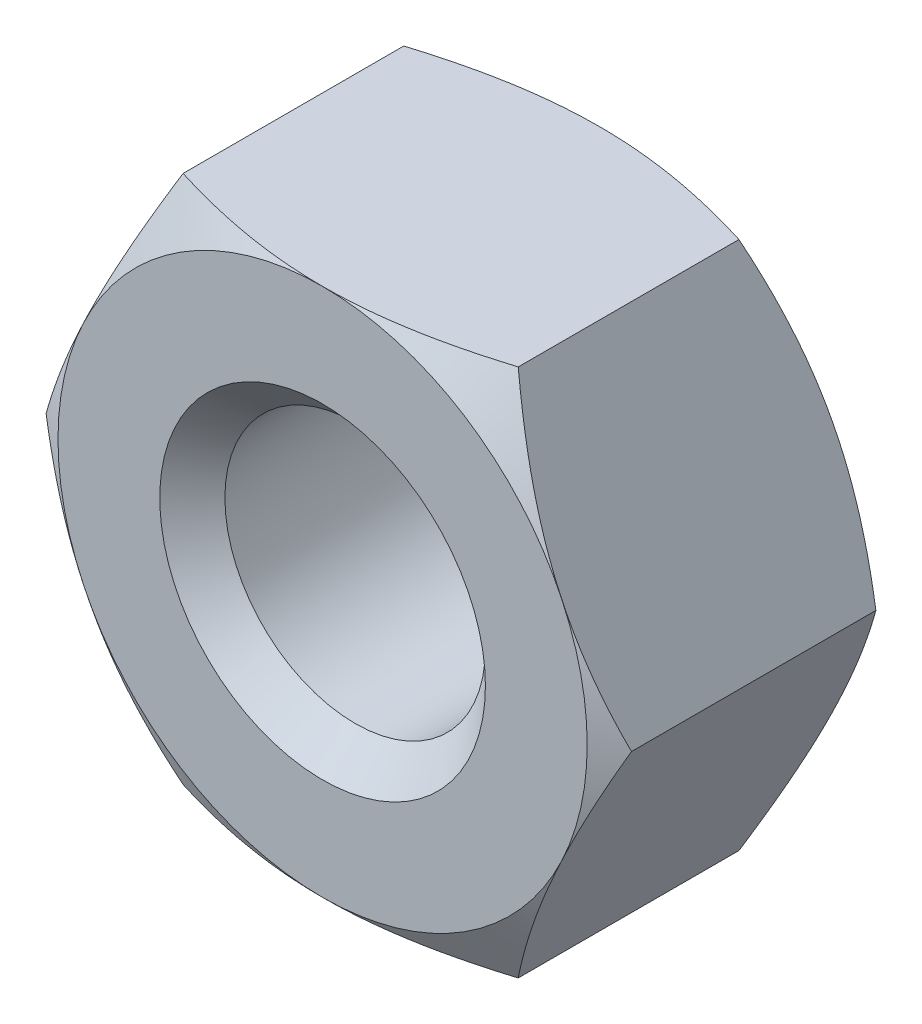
ISO-10303-21;
HEADER;
FILE_DESCRIPTION(('STEP AP214'),'2;1');
FILE_NAME('part.step','',(''),(''),'','','');
FILE_SCHEMA(('AUTOMOTIVE_DESIGN { 1 0 10303 214 1 1 1 1 }'));
ENDSEC;
DATA;
#1=APPLICATION_CONTEXT('core data for automotive mechanical design processes');
#2=APPLICATION_PROTOCOL_DEFINITION('international standard','automotive_design',2000,#1);
#3=PRODUCT_CONTEXT('',#1,'mechanical');
#4=PRODUCT('Part','Part','',(#3));
#5=PRODUCT_RELATED_PRODUCT_CATEGORY('part','',(#4));
#6=PRODUCT_DEFINITION_FORMATION('','',#4);
#7=PRODUCT_DEFINITION_CONTEXT('part definition',#1,'design');
#8=PRODUCT_DEFINITION('design','',#6,#7);
#9=PRODUCT_DEFINITION_SHAPE('','',#8);
#10=(LENGTH_UNIT() NAMED_UNIT(*) SI_UNIT(.MILLI.,.METRE.));
#11=(NAMED_UNIT(*) PLANE_ANGLE_UNIT() SI_UNIT($,.RADIAN.));
#12=(NAMED_UNIT(*) SI_UNIT($,.STERADIAN.) SOLID_ANGLE_UNIT());
#13=UNCERTAINTY_MEASURE_WITH_UNIT(LENGTH_MEASURE(1.E-05),#10,'distance_accuracy_value','');
#14=(GEOMETRIC_REPRESENTATION_CONTEXT(3) GLOBAL_UNCERTAINTY_ASSIGNED_CONTEXT((#13)) GLOBAL_UNIT_ASSIGNED_CONTEXT((#10,
#11,#12)) REPRESENTATION_CONTEXT('',''));
#15=CARTESIAN_POINT('',(0.,0.,0.));
#16=DIRECTION('',(0.,0.,1.));
#17=DIRECTION('',(1.,0.,0.));
#18=AXIS2_PLACEMENT_3D('',#15,#16,#17);
#19=CARTESIAN_POINT('',(-10.2634508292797,6.50000000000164,6.80000000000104));
#20=DIRECTION('',(0.,0.,-1.));
#21=DIRECTION('',(-1.,0.,0.));
#22=AXIS2_PLACEMENT_3D('',#19,#20,#21);
#23=PLANE('',#22);
#24=CARTESIAN_POINT('',(9.43689570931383E-13,6.38378239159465E-13,6.79999999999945));
#25=DIRECTION('',(0.,0.,-1.));
#26=DIRECTION('',(-1.,0.,0.));
#27=AXIS2_PLACEMENT_3D('',#24,#25,#26);
#28=CIRCLE('',#27,4.00000000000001);
#29=CARTESIAN_POINT('',(4.00000000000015,3.63236427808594E-13,6.79999999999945));
#30=VERTEX_POINT('',#29);
#31=EDGE_CURVE('E46',#30,#30,#28,.T.);
#32=ORIENTED_EDGE('',*,*,#31,.T.);
#33=EDGE_LOOP('',(#32));
#34=FACE_BOUND('',#33,.T.);
#35=CARTESIAN_POINT('',(9.43689570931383E-13,6.38378239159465E-13,6.79999999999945));
#36=DIRECTION('',(0.,0.,-1.));
#37=DIRECTION('',(-1.,0.,0.));
#38=AXIS2_PLACEMENT_3D('',#35,#36,#37);
#39=CIRCLE('',#38,6.5);
#40=CARTESIAN_POINT('',(-5.87621696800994,2.77850214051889,6.79999999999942));
#41=VERTEX_POINT('',#40);
#42=CARTESIAN_POINT('',(0.,6.50000000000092,6.79999999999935));
#43=VERTEX_POINT('',#42);
#44=EDGE_CURVE('E303',#41,#43,#39,.T.);
#45=ORIENTED_EDGE('',*,*,#44,.F.);
#46=CARTESIAN_POINT('',(-5.87621696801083,-2.77850214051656,6.80000000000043));
#47=VERTEX_POINT('',#46);
#48=EDGE_CURVE('E307',#47,#41,#39,.T.);
#49=ORIENTED_EDGE('',*,*,#48,.F.);
#50=CARTESIAN_POINT('',(7.7715611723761E-13,-6.49999999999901,6.7999999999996));
#51=VERTEX_POINT('',#50);
#52=EDGE_CURVE('E351',#51,#47,#39,.T.);
#53=ORIENTED_EDGE('',*,*,#52,.F.);
#54=CARTESIAN_POINT('',(5.87621696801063,-2.77850214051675,6.79999999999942));
#55=VERTEX_POINT('',#54);
#56=EDGE_CURVE('E360',#55,#51,#39,.T.);
#57=ORIENTED_EDGE('',*,*,#56,.F.);
#58=CARTESIAN_POINT('',(5.87621696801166,2.77850214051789,6.79999999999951));
#59=VERTEX_POINT('',#58);
#60=EDGE_CURVE('E313',#59,#55,#39,.T.);
#61=ORIENTED_EDGE('',*,*,#60,.F.);
#62=CARTESIAN_POINT('',(9.43689570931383E-13,6.38378239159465E-13,6.79999999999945));
#63=DIRECTION('',(0.,0.,1.));
#64=DIRECTION('',(1.,0.,0.));
#65=AXIS2_PLACEMENT_3D('',#62,#63,#64);
#66=CIRCLE('',#65,6.5);
#67=EDGE_CURVE('E158',#59,#43,#66,.T.);
#68=ORIENTED_EDGE('',*,*,#67,.T.);
#69=EDGE_LOOP('',(#45,#49,#53,#57,#61,#68));
#70=FACE_BOUND('',#69,.T.);
#71=ADVANCED_FACE('F36',(#34,#70),#23,.F.);
#72=CARTESIAN_POINT('',(9.43689570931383E-13,6.38378239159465E-13,6.79999999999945));
#73=DIRECTION('',(0.,0.,-1.));
#74=DIRECTION('',(-1.,0.,0.));
#75=AXIS2_PLACEMENT_3D('',#72,#73,#74);
#76=CONICAL_SURFACE('',#75,6.5,1.0471975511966);
#77=ORIENTED_EDGE('',*,*,#48,.T.);
#78=CARTESIAN_POINT('',(-7.19009456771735,-0.000199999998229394,6.4015737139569));
#79=CARTESIAN_POINT('',(-7.12176791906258,0.144303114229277,6.44102728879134));
#80=CARTESIAN_POINT('',(-7.05318289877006,0.289352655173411,6.4781100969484));
#81=CARTESIAN_POINT('',(-6.91550949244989,0.580516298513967,6.54699293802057));
#82=CARTESIAN_POINT('',(-6.84642096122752,0.726630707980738,6.57879137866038));
#83=CARTESIAN_POINT('',(-6.70770669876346,1.01999564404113,6.63657665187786));
#84=CARTESIAN_POINT('',(-6.6380803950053,1.16724738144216,6.66255602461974));
#85=CARTESIAN_POINT('',(-6.49845186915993,1.46254588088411,6.70813499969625));
#86=CARTESIAN_POINT('',(-6.42844968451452,1.61059256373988,6.72773522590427));
#87=CARTESIAN_POINT('',(-6.28970966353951,1.90401197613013,6.75976932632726));
#88=CARTESIAN_POINT('',(-6.22097815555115,2.04937132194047,6.7723522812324));
#89=CARTESIAN_POINT('',(-6.08334978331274,2.34043972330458,6.79072313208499));
#90=CARTESIAN_POINT('',(-6.01445292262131,2.48614877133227,6.79651117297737));
#91=CARTESIAN_POINT('',(-5.87667105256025,2.77754180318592,6.80115163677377));
#92=CARTESIAN_POINT('',(-5.80778607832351,2.9232257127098,6.80000964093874));
#93=CARTESIAN_POINT('',(-5.67010485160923,3.21440589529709,6.79083601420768));
#94=CARTESIAN_POINT('',(-5.60130859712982,3.35990217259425,6.78280454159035));
#95=CARTESIAN_POINT('',(-5.41352397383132,3.75704535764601,6.75166525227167));
#96=CARTESIAN_POINT('',(-5.29473102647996,4.00827897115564,6.72182021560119));
#97=CARTESIAN_POINT('',(-5.058190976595,4.50853435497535,6.64381289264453));
#98=CARTESIAN_POINT('',(-4.94044469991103,4.75755437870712,6.59563726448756));
#99=CARTESIAN_POINT('',(-4.70398875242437,5.25763189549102,6.48248364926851));
#100=CARTESIAN_POINT('',(-4.58530751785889,5.50862924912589,6.41718649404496));
#101=CARTESIAN_POINT('',(-4.34964856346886,6.00702121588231,6.27322895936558));
#102=CARTESIAN_POINT('',(-4.23266821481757,6.25442138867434,6.19459228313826));
#103=CARTESIAN_POINT('',(-4.11645460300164,6.50020000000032,6.1106376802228));
#104=B_SPLINE_CURVE_WITH_KNOTS('',3,(#78,#79,#80,#81,#82,#83,#84,#85,#86,#87,#88,#89,#90,#91,
#92,#93,#94,#95,#96,#97,#98,#99,#100,#101,#102,#103),.UNSPECIFIED.,.F.,.F.,(4,2,2,2,2,2,2,2,2,2,
2,2,4),(0.,0.493929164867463,0.988006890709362,1.48271442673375,1.97737356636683,
2.46107896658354,2.94477404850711,3.42807962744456,3.91137410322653,4.7491405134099,
5.58751785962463,6.44279759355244,7.29657318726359),.UNSPECIFIED.);
#105=CARTESIAN_POINT('',(-7.1900000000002,3.88578058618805E-13,6.40162831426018));
#106=VERTEX_POINT('',#105);
#107=EDGE_CURVE('E318',#106,#41,#104,.T.);
#108=ORIENTED_EDGE('',*,*,#107,.F.);
#109=CARTESIAN_POINT('',(-4.11645460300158,-6.50019999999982,6.11063768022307));
#110=CARTESIAN_POINT('',(-4.25998685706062,-6.19664555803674,6.2143476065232));
#111=CARTESIAN_POINT('',(-4.4047746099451,-5.89043587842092,6.30996774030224));
#112=CARTESIAN_POINT('',(-4.69702892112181,-5.27235114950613,6.47992500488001));
#113=CARTESIAN_POINT('',(-4.84450192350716,-4.96046247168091,6.55420087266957));
#114=CARTESIAN_POINT('',(-5.06542285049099,-4.49323976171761,6.64459650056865));
#115=CARTESIAN_POINT('',(-5.13809809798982,-4.33953985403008,6.67101787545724));
#116=CARTESIAN_POINT('',(-5.28384739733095,-4.03129661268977,6.71685352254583));
#117=CARTESIAN_POINT('',(-5.3569214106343,-3.87675336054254,6.73626846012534));
#118=CARTESIAN_POINT('',(-5.50327399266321,-3.56723424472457,6.7676011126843));
#119=CARTESIAN_POINT('',(-5.57655219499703,-3.41225915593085,6.77952810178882));
#120=CARTESIAN_POINT('',(-5.72325843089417,-3.1019921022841,6.79561616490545));
#121=CARTESIAN_POINT('',(-5.79668645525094,-2.94670015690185,6.7997777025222));
#122=CARTESIAN_POINT('',(-5.98025949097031,-2.55846400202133,6.80031082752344));
#123=CARTESIAN_POINT('',(-6.09041366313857,-2.3255004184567,6.79174955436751));
#124=CARTESIAN_POINT('',(-6.31028424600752,-1.86049906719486,6.75735195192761));
#125=CARTESIAN_POINT('',(-6.42000033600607,-1.62846197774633,6.73150470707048));
#126=CARTESIAN_POINT('',(-6.64056244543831,-1.16199812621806,6.66334309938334));
#127=CARTESIAN_POINT('',(-6.75139121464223,-0.927607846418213,6.62072977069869));
#128=CARTESIAN_POINT('',(-6.97174201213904,-0.461590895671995,6.52127637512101));
#129=CARTESIAN_POINT('',(-7.08126548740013,-0.229961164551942,6.46445397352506));
#130=CARTESIAN_POINT('',(-7.1900945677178,0.000200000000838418,6.4015737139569));
#131=B_SPLINE_CURVE_WITH_KNOTS('',3,(#109,#110,#111,#112,#113,#114,#115,#116,#117,#118,#119,
#120,#121,#122,#123,#124,#125,#126,#127,#128,#129,#130),.UNSPECIFIED.,.F.,.F.,(4,2,2,2,2,2,2,2,
2,2,4),(0.,1.05485863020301,2.11271538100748,2.62875230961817,3.14474021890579,3.6600877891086,
4.17540459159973,4.94827203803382,5.72162798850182,6.50944915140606,7.29629569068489),.UNSPECIFIED.);
#132=EDGE_CURVE('E238',#47,#106,#131,.T.);
#133=ORIENTED_EDGE('',*,*,#132,.F.);
#134=EDGE_LOOP('',(#77,#108,#133));
#135=FACE_BOUND('',#134,.T.);
#136=ADVANCED_FACE('F289',(#135),#76,.T.);
#137=ORIENTED_EDGE('',*,*,#52,.T.);
#138=CARTESIAN_POINT('',(-4.11654917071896,-6.49999999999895,6.11070602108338));
#139=VERTEX_POINT('',#138);
#140=EDGE_CURVE('E245',#139,#47,#131,.T.);
#141=ORIENTED_EDGE('',*,*,#140,.F.);
#142=CARTESIAN_POINT('',(-10.4557340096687,-6.50000000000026,3.44474435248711));
#143=CARTESIAN_POINT('',(-10.1685468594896,-6.49999999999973,3.58552407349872));
#144=CARTESIAN_POINT('',(-9.88073953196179,-6.49999999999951,3.72505851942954));
#145=CARTESIAN_POINT('',(-9.30355614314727,-6.49999999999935,4.00094341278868));
#146=CARTESIAN_POINT('',(-9.014179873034,-6.49999999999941,4.13729342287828));
#147=CARTESIAN_POINT('',(-8.43220987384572,-6.49999999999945,4.40672467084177));
#148=CARTESIAN_POINT('',(-8.13960736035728,-6.49999999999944,4.53978699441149));
#149=CARTESIAN_POINT('',(-7.55220336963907,-6.49999999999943,4.80094714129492));
#150=CARTESIAN_POINT('',(-7.25740198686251,-6.49999999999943,4.92904517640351));
#151=CARTESIAN_POINT('',(-6.65414621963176,-6.49999999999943,5.18361493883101));
#152=CARTESIAN_POINT('',(-6.34559132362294,-6.49999999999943,5.30984968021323));
#153=CARTESIAN_POINT('',(-5.72501172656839,-6.49999999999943,5.55364253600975));
#154=CARTESIAN_POINT('',(-5.41298666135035,-6.49999999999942,5.67119972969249));
#155=CARTESIAN_POINT('',(-4.78544506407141,-6.49999999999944,5.89482181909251));
#156=CARTESIAN_POINT('',(-4.46993587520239,-6.49999999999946,6.00090713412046));
#157=CARTESIAN_POINT('',(-3.83440248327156,-6.4999999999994,6.19843064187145));
#158=CARTESIAN_POINT('',(-3.51437961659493,-6.49999999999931,6.28987307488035));
#159=CARTESIAN_POINT('',(-2.87158202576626,-6.49999999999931,6.45345380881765));
#160=CARTESIAN_POINT('',(-2.54883874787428,-6.4999999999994,6.52571382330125));
#161=CARTESIAN_POINT('',(-1.89892618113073,-6.49999999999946,6.64715175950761));
#162=CARTESIAN_POINT('',(-1.57175738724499,-6.49999999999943,6.69633224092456));
#163=CARTESIAN_POINT('',(-1.08117020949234,-6.49999999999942,6.74955448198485));
#164=CARTESIAN_POINT('',(-0.918827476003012,-6.49999999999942,6.7638398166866));
#165=CARTESIAN_POINT('',(-0.593675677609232,-6.49999999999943,6.78553153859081));
#166=CARTESIAN_POINT('',(-0.430866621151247,-6.49999999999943,6.79293804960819));
#167=CARTESIAN_POINT('',(-0.105083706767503,-6.49999999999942,6.80068620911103));
#168=CARTESIAN_POINT('',(0.0578901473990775,-6.49999999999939,6.80102801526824));
#169=CARTESIAN_POINT('',(0.383701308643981,-6.49999999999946,6.79464303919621));
#170=CARTESIAN_POINT('',(0.546538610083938,-6.49999999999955,6.78791597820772));
#171=CARTESIAN_POINT('',(0.927224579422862,-6.49999999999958,6.76407395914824));
#172=CARTESIAN_POINT('',(1.14490501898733,-6.49999999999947,6.74419976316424));
#173=CARTESIAN_POINT('',(1.57887674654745,-6.49999999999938,6.69282525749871));
#174=CARTESIAN_POINT('',(1.79516787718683,-6.49999999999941,6.66132365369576));
#175=CARTESIAN_POINT('',(2.44159504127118,-6.49999999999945,6.55102923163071));
#176=CARTESIAN_POINT('',(2.86908804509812,-6.49999999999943,6.45646095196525));
#177=CARTESIAN_POINT('',(3.5086258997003,-6.49999999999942,6.28963773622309));
#178=CARTESIAN_POINT('',(3.72390734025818,-6.49999999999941,6.22904846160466));
#179=CARTESIAN_POINT('',(4.15239210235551,-6.49999999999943,6.10085514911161));
#180=CARTESIAN_POINT('',(4.36559540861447,-6.49999999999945,6.03325105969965));
#181=CARTESIAN_POINT('',(4.78997409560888,-6.49999999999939,5.892170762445));
#182=CARTESIAN_POINT('',(5.0011499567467,-6.49999999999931,5.81869598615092));
#183=CARTESIAN_POINT('',(5.42170873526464,-6.49999999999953,5.66680929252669));
#184=CARTESIAN_POINT('',(5.63109168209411,-6.49999999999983,5.58839745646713));
#185=CARTESIAN_POINT('',(6.15107874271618,-6.49999999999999,5.38776608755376));
#186=CARTESIAN_POINT('',(6.46070089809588,-6.49999999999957,5.26300526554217));
#187=CARTESIAN_POINT('',(7.07698837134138,-6.49999999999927,5.0063583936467));
#188=CARTESIAN_POINT('',(7.38365342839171,-6.49999999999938,4.87447172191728));
#189=CARTESIAN_POINT('',(7.99461705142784,-6.49999999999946,4.60508787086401));
#190=CARTESIAN_POINT('',(8.29891484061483,-6.49999999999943,4.46758893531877));
#191=CARTESIAN_POINT('',(8.90546540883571,-6.49999999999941,4.18818946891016));
#192=CARTESIAN_POINT('',(9.20771825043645,-6.49999999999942,4.04628907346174));
#193=CARTESIAN_POINT('',(9.81096787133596,-6.49999999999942,3.75875789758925));
#194=CARTESIAN_POINT('',(10.1119622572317,-6.49999999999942,3.61312210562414));
#195=CARTESIAN_POINT('',(10.7125466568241,-6.49999999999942,3.31898002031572));
#196=CARTESIAN_POINT('',(11.0121366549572,-6.49999999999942,3.17047369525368));
#197=CARTESIAN_POINT('',(11.9090437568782,-6.49999999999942,2.72151297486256));
#198=CARTESIAN_POINT('',(12.5046104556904,-6.49999999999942,2.41756270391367));
#199=CARTESIAN_POINT('',(13.6370680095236,-6.49999999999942,1.83186769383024));
#200=CARTESIAN_POINT('',(14.1742551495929,-6.49999999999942,1.55069297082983));
#201=CARTESIAN_POINT('',(15.2465813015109,-6.49999999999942,0.984403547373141));
#202=CARTESIAN_POINT('',(15.7817202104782,-6.49999999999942,0.699288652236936));
#203=CARTESIAN_POINT('',(16.8487138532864,-6.49999999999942,0.127004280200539));
#204=CARTESIAN_POINT('',(17.3805736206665,-6.49999999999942,-0.160155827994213));
#205=CARTESIAN_POINT('',(18.442996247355,-6.49999999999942,-0.73677657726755));
#206=CARTESIAN_POINT('',(18.9735591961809,-6.49999999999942,-1.02623705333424));
#207=CARTESIAN_POINT('',(19.5036538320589,-6.49999999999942,-1.31654663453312));
#208=B_SPLINE_CURVE_WITH_KNOTS('',3,(#142,#143,#144,#145,#146,#147,#148,#149,#150,#151,#152,
#153,#154,#155,#156,#157,#158,#159,#160,#161,#162,#163,#164,#165,#166,#167,#168,#169,#170,#171,
#172,#173,#174,#175,#176,#177,#178,#179,#180,#181,#182,#183,#184,#185,#186,#187,#188,#189,#190,
#191,#192,#193,#194,#195,#196,#197,#198,#199,#200,#201,#202,#203,#204,#205,#206,#207),
.UNSPECIFIED.,.F.,.F.,(4,2,2,2,2,2,2,2,2,2,2,2,2,2,2,2,2,2,2,2,2,2,2,2,2,2,2,2,2,2,2,2,4),(0.,
0.959519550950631,1.91917011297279,2.88344432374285,3.84767734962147,4.84771238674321,
5.84785338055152,6.84618381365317,7.84422462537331,8.83577265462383,9.82721068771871,
10.3159973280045,10.8047751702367,11.2935421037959,11.7823283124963,12.437722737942,
13.0931901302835,14.404714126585,15.0755831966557,15.7464571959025,16.4171681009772,
17.0878679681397,18.089182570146,19.0905846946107,20.0923026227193,21.093989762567,
22.0970994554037,23.1002202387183,25.1060873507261,26.9250433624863,28.7440895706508,
30.5573738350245,32.3705291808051),.UNSPECIFIED.);
#209=EDGE_CURVE('E258',#51,#139,#208,.F.);
#210=ORIENTED_EDGE('',*,*,#209,.F.);
#211=EDGE_LOOP('',(#137,#141,#210));
#212=FACE_BOUND('',#211,.T.);
#213=ADVANCED_FACE('F294',(#212),#76,.T.);
#214=ORIENTED_EDGE('',*,*,#56,.T.);
#215=CARTESIAN_POINT('',(4.1165491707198,-6.49999999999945,6.11070602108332));
#216=VERTEX_POINT('',#215);
#217=EDGE_CURVE('E265',#216,#51,#208,.F.);
#218=ORIENTED_EDGE('',*,*,#217,.F.);
#219=CARTESIAN_POINT('',(7.19009456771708,0.000200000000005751,6.4015737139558));
#220=CARTESIAN_POINT('',(7.12176791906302,-0.14430311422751,6.44102728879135));
#221=CARTESIAN_POINT('',(7.05318289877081,-0.289352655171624,6.47811009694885));
#222=CARTESIAN_POINT('',(6.91550949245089,-0.580516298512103,6.54699293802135));
#223=CARTESIAN_POINT('',(6.84642096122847,-0.726630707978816,6.57879137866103));
#224=CARTESIAN_POINT('',(6.70770669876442,-1.01999564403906,6.63657665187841));
#225=CARTESIAN_POINT('',(6.63808039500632,-1.16724738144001,6.66255602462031));
#226=CARTESIAN_POINT('',(6.49845186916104,-1.46254588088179,6.70813499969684));
#227=CARTESIAN_POINT('',(6.42844968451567,-1.61059256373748,6.72773522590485));
#228=CARTESIAN_POINT('',(6.28970966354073,-1.90401197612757,6.75976932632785));
#229=CARTESIAN_POINT('',(6.22097815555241,-2.04937132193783,6.77235228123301));
#230=CARTESIAN_POINT('',(6.08334978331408,-2.34043972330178,6.7907231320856));
#231=CARTESIAN_POINT('',(6.01445292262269,-2.4861487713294,6.79651117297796));
#232=CARTESIAN_POINT('',(5.87667105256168,-2.77754180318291,6.80115163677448));
#233=CARTESIAN_POINT('',(5.80778607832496,-2.92322571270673,6.80000964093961));
#234=CARTESIAN_POINT('',(5.67010485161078,-3.21440589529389,6.79083601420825));
#235=CARTESIAN_POINT('',(5.60130859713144,-3.35990217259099,6.78280454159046));
#236=CARTESIAN_POINT('',(5.41352397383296,-3.75704535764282,6.75166525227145));
#237=CARTESIAN_POINT('',(5.29473102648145,-4.00827897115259,6.72182021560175));
#238=CARTESIAN_POINT('',(5.05819097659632,-4.50853435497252,6.64381289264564));
#239=CARTESIAN_POINT('',(4.94044469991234,-4.75755437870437,6.59563726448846));
#240=CARTESIAN_POINT('',(4.7039887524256,-5.25763189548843,6.48248364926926));
#241=CARTESIAN_POINT('',(4.58530751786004,-5.50862924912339,6.41718649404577));
#242=CARTESIAN_POINT('',(4.34964856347,-6.00702121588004,6.27322895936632));
#243=CARTESIAN_POINT('',(4.23266821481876,-6.25442138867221,6.19459228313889));
#244=CARTESIAN_POINT('',(4.11645460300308,-6.50019999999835,6.11063768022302));
#245=B_SPLINE_CURVE_WITH_KNOTS('',3,(#219,#220,#221,#222,#223,#224,#225,#226,#227,#228,#229,
#230,#231,#232,#233,#234,#235,#236,#237,#238,#239,#240,#241,#242,#243,#244),.UNSPECIFIED.,.F.,
.F.,(4,2,2,2,2,2,2,2,2,2,2,2,4),(0.,0.493929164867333,0.988006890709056,1.48271442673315,
1.97737356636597,2.46107896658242,2.94477404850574,3.42807962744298,3.91137410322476,
4.74914051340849,5.58751785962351,6.44279759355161,7.29657318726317),.UNSPECIFIED.);
#246=EDGE_CURVE('E266',#55,#216,#245,.T.);
#247=ORIENTED_EDGE('',*,*,#246,.F.);
#248=EDGE_LOOP('',(#214,#218,#247));
#249=FACE_BOUND('',#248,.T.);
#250=ADVANCED_FACE('F496',(#249),#76,.T.);
#251=CARTESIAN_POINT('',(4.11645460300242,6.50020000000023,6.11063768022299));
#252=CARTESIAN_POINT('',(4.25998685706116,6.19664555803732,6.21434760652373));
#253=CARTESIAN_POINT('',(4.40477460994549,5.89043587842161,6.30996774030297));
#254=CARTESIAN_POINT('',(4.69702892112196,5.27235114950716,6.47992500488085));
#255=CARTESIAN_POINT('',(4.84450192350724,4.96046247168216,6.5542008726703));
#256=CARTESIAN_POINT('',(5.06542285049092,4.49323976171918,6.6445965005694));
#257=CARTESIAN_POINT('',(5.13809809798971,4.33953985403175,6.67101787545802));
#258=CARTESIAN_POINT('',(5.28384739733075,4.03129661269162,6.71685352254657));
#259=CARTESIAN_POINT('',(5.35692141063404,3.87675336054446,6.73626846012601));
#260=CARTESIAN_POINT('',(5.50327399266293,3.56723424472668,6.76760111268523));
#261=CARTESIAN_POINT('',(5.57655219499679,3.41225915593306,6.77952810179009));
#262=CARTESIAN_POINT('',(5.72325843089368,3.1019921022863,6.79561616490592));
#263=CARTESIAN_POINT('',(5.79668645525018,2.94670015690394,6.79977770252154));
#264=CARTESIAN_POINT('',(5.98025949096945,2.55846400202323,6.80031082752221));
#265=CARTESIAN_POINT('',(6.09041366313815,2.32550041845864,6.79174955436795));
#266=CARTESIAN_POINT('',(6.31028424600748,1.86049906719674,6.75735195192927));
#267=CARTESIAN_POINT('',(6.42000033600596,1.62846197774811,6.73150470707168));
#268=CARTESIAN_POINT('',(6.64056244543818,1.16199812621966,6.66334309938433));
#269=CARTESIAN_POINT('',(6.75139121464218,0.927607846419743,6.62072977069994));
#270=CARTESIAN_POINT('',(6.97174201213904,0.461590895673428,6.52127637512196));
#271=CARTESIAN_POINT('',(7.08126548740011,0.229961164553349,6.46445397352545));
#272=CARTESIAN_POINT('',(7.19009456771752,-0.000199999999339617,6.40157371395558));
#273=B_SPLINE_CURVE_WITH_KNOTS('',3,(#251,#252,#253,#254,#255,#256,#257,#258,#259,#260,#261,
#262,#263,#264,#265,#266,#267,#268,#269,#270,#271,#272),.UNSPECIFIED.,.F.,.F.,(4,2,2,2,2,2,2,2,
2,2,4),(0.,1.05485863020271,2.11271538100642,2.62875230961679,3.14474021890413,3.66008778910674,
4.17540459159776,4.94827203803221,5.72162798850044,6.50944915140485,7.29629569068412),.UNSPECIFIED.);
#274=CARTESIAN_POINT('',(7.19000000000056,6.10622663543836E-13,6.40162831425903));
#275=VERTEX_POINT('',#274);
#276=EDGE_CURVE('E61',#59,#275,#273,.T.);
#277=ORIENTED_EDGE('',*,*,#276,.F.);
#278=ORIENTED_EDGE('',*,*,#60,.T.);
#279=EDGE_CURVE('E273',#275,#55,#245,.T.);
#280=ORIENTED_EDGE('',*,*,#279,.F.);
#281=EDGE_LOOP('',(#277,#278,#280));
#282=FACE_BOUND('',#281,.T.);
#283=ADVANCED_FACE('F483',(#282),#76,.T.);
#284=CARTESIAN_POINT('',(-10.4557340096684,6.50000000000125,3.44474435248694));
#285=CARTESIAN_POINT('',(-10.1685468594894,6.50000000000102,3.58552407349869));
#286=CARTESIAN_POINT('',(-9.88073953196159,6.50000000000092,3.72505851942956));
#287=CARTESIAN_POINT('',(-9.3035561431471,6.50000000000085,4.00094341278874));
#288=CARTESIAN_POINT('',(-9.01417987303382,6.50000000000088,4.13729342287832));
#289=CARTESIAN_POINT('',(-8.43220987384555,6.5000000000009,4.40672467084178));
#290=CARTESIAN_POINT('',(-8.13960736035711,6.50000000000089,4.53978699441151));
#291=CARTESIAN_POINT('',(-7.55220336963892,6.50000000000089,4.80094714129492));
#292=CARTESIAN_POINT('',(-7.25740198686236,6.50000000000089,4.92904517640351));
#293=CARTESIAN_POINT('',(-6.65414621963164,6.50000000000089,5.18361493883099));
#294=CARTESIAN_POINT('',(-6.34559132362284,6.50000000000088,5.3098496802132));
#295=CARTESIAN_POINT('',(-5.72501172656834,6.50000000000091,5.55364253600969));
#296=CARTESIAN_POINT('',(-5.41298666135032,6.50000000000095,5.67119972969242));
#297=CARTESIAN_POINT('',(-4.78544506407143,6.50000000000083,5.89482181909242));
#298=CARTESIAN_POINT('',(-4.46993587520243,6.50000000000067,6.00090713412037));
#299=CARTESIAN_POINT('',(-3.83440248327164,6.50000000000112,6.19843064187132));
#300=CARTESIAN_POINT('',(-3.51437961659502,6.50000000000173,6.28987307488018));
#301=CARTESIAN_POINT('',(-2.87158202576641,6.50000000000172,6.45345380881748));
#302=CARTESIAN_POINT('',(-2.54883874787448,6.5000000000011,6.5257138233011));
#303=CARTESIAN_POINT('',(-1.89892618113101,6.50000000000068,6.64715175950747));
#304=CARTESIAN_POINT('',(-1.57175738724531,6.50000000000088,6.69633224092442));
#305=CARTESIAN_POINT('',(-1.08117020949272,6.5000000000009,6.74955448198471));
#306=CARTESIAN_POINT('',(-0.918827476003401,6.50000000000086,6.76383981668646));
#307=CARTESIAN_POINT('',(-0.593675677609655,6.50000000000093,6.78553153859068));
#308=CARTESIAN_POINT('',(-0.430866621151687,6.50000000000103,6.79293804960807));
#309=CARTESIAN_POINT('',(-0.105083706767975,6.50000000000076,6.80068620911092));
#310=CARTESIAN_POINT('',(0.0578901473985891,6.5000000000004,6.80102801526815));
#311=CARTESIAN_POINT('',(0.383701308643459,6.50000000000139,6.79464303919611));
#312=CARTESIAN_POINT('',(0.546538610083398,6.50000000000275,6.78791597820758));
#313=CARTESIAN_POINT('',(0.927224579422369,6.50000000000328,6.7640739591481));
#314=CARTESIAN_POINT('',(1.1449050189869,6.50000000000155,6.74419976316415));
#315=CARTESIAN_POINT('',(1.57887674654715,6.50000000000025,6.69282525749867));
#316=CARTESIAN_POINT('',(1.79516787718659,6.50000000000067,6.6613236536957));
#317=CARTESIAN_POINT('',(2.44159504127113,6.50000000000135,6.55102923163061));
#318=CARTESIAN_POINT('',(2.86908804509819,6.50000000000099,6.45646095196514));
#319=CARTESIAN_POINT('',(3.50862589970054,6.50000000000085,6.28963773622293));
#320=CARTESIAN_POINT('',(3.72390734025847,6.50000000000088,6.22904846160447));
#321=CARTESIAN_POINT('',(4.15239210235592,6.50000000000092,6.1008551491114));
#322=CARTESIAN_POINT('',(4.36559540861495,6.50000000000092,6.03325105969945));
#323=CARTESIAN_POINT('',(4.78997409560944,6.50000000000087,5.89217076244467));
#324=CARTESIAN_POINT('',(5.00114995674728,6.50000000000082,5.81869598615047));
#325=CARTESIAN_POINT('',(5.42170873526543,6.50000000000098,5.66680929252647));
#326=CARTESIAN_POINT('',(5.63109168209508,6.50000000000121,5.58839745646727));
#327=CARTESIAN_POINT('',(6.15107874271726,6.50000000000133,5.38776608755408));
#328=CARTESIAN_POINT('',(6.46070089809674,6.50000000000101,5.26300526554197));
#329=CARTESIAN_POINT('',(7.07698837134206,6.50000000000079,5.00635839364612));
#330=CARTESIAN_POINT('',(7.38365342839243,6.50000000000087,4.87447172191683));
#331=CARTESIAN_POINT('',(7.99461705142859,6.50000000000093,4.60508787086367));
#332=CARTESIAN_POINT('',(8.29891484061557,6.50000000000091,4.46758893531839));
#333=CARTESIAN_POINT('',(8.90546540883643,6.50000000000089,4.18818946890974));
#334=CARTESIAN_POINT('',(9.20771825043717,6.5000000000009,4.04628907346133));
#335=CARTESIAN_POINT('',(9.81096787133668,6.5000000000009,3.75875789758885));
#336=CARTESIAN_POINT('',(10.1119622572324,6.5000000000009,3.61312210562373));
#337=CARTESIAN_POINT('',(10.7125466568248,6.5000000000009,3.3189800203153));
#338=CARTESIAN_POINT('',(11.0121366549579,6.5000000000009,3.17047369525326));
#339=CARTESIAN_POINT('',(11.909043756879,6.5000000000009,2.72151297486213));
#340=CARTESIAN_POINT('',(12.5046104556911,6.5000000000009,2.41756270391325));
#341=CARTESIAN_POINT('',(13.6370680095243,6.5000000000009,1.83186769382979));
#342=CARTESIAN_POINT('',(14.1742551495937,6.50000000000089,1.55069297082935));
#343=CARTESIAN_POINT('',(15.2465813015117,6.50000000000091,0.984403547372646));
#344=CARTESIAN_POINT('',(15.7817202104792,6.50000000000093,0.699288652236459));
#345=CARTESIAN_POINT('',(16.8487138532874,6.50000000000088,0.12700428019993));
#346=CARTESIAN_POINT('',(17.3805736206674,6.50000000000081,-0.16015582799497));
#347=CARTESIAN_POINT('',(18.4429962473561,6.500000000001,-0.736776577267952));
#348=CARTESIAN_POINT('',(18.9735591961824,6.50000000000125,-1.02623705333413));
#349=CARTESIAN_POINT('',(19.503653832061,6.50000000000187,-1.31654663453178));
#350=B_SPLINE_CURVE_WITH_KNOTS('',3,(#284,#285,#286,#287,#288,#289,#290,#291,#292,#293,#294,
#295,#296,#297,#298,#299,#300,#301,#302,#303,#304,#305,#306,#307,#308,#309,#310,#311,#312,#313,
#314,#315,#316,#317,#318,#319,#320,#321,#322,#323,#324,#325,#326,#327,#328,#329,#330,#331,#332,
#333,#334,#335,#336,#337,#338,#339,#340,#341,#342,#343,#344,#345,#346,#347,#348,#349),
.UNSPECIFIED.,.F.,.F.,(4,2,2,2,2,2,2,2,2,2,2,2,2,2,2,2,2,2,2,2,2,2,2,2,2,2,2,2,2,2,2,2,4),(0.,
0.959519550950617,1.91917011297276,2.88344432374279,3.84767734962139,4.84771238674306,
5.84785338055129,6.84618381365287,7.84422462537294,8.83577265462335,9.82721068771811,
10.3159973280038,10.804775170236,11.2935421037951,11.7823283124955,12.4377227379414,
13.093190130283,14.4047141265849,15.0755831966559,15.7464571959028,16.4171681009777,
17.0878679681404,18.0891825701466,19.0905846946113,20.0923026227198,21.0939897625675,
22.0970994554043,23.1002202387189,25.1060873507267,26.925043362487,28.7440895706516,
30.5573738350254,32.3705291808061),.UNSPECIFIED.);
#351=CARTESIAN_POINT('',(4.11654917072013,6.50000000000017,6.11070602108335));
#352=VERTEX_POINT('',#351);
#353=EDGE_CURVE('E53',#43,#352,#350,.T.);
#354=ORIENTED_EDGE('',*,*,#353,.F.);
#355=ORIENTED_EDGE('',*,*,#67,.F.);
#356=EDGE_CURVE('E251',#352,#59,#273,.T.);
#357=ORIENTED_EDGE('',*,*,#356,.F.);
#358=EDGE_LOOP('',(#354,#355,#357));
#359=FACE_BOUND('',#358,.T.);
#360=ADVANCED_FACE('F296',(#359),#76,.T.);
#361=CARTESIAN_POINT('',(-4.11654917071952,6.50000000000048,6.11070602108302));
#362=VERTEX_POINT('',#361);
#363=EDGE_CURVE('E224',#41,#362,#104,.T.);
#364=ORIENTED_EDGE('',*,*,#363,.F.);
#365=ORIENTED_EDGE('',*,*,#44,.T.);
#366=EDGE_CURVE('E246',#362,#43,#350,.T.);
#367=ORIENTED_EDGE('',*,*,#366,.F.);
#368=EDGE_LOOP('',(#364,#365,#367));
#369=FACE_BOUND('',#368,.T.);
#370=ADVANCED_FACE('F193',(#369),#76,.T.);
#371=CARTESIAN_POINT('',(-4.11654917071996,-6.49999999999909,6.7999999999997));
#372=DIRECTION('',(-0.904033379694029,-0.427461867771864,0.));
#373=DIRECTION('',(0.427461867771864,-0.904033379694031,0.));
#374=AXIS2_PLACEMENT_3D('',#371,#372,#373);
#375=PLANE('',#374);
#376=DIRECTION('',(0.,0.,-1.));
#377=VECTOR('',#376,1.);
#378=CARTESIAN_POINT('',(-7.18999999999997,8.32667268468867E-13,6.80000000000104));
#379=LINE('',#378,#377);
#380=CARTESIAN_POINT('',(-7.19000000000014,1.94289029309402E-12,0.398371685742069));
#381=VERTEX_POINT('',#380);
#382=EDGE_CURVE('E274',#106,#381,#379,.T.);
#383=ORIENTED_EDGE('',*,*,#382,.T.);
#384=CARTESIAN_POINT('',(-7.19009456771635,0.000200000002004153,0.398426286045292));
#385=CARTESIAN_POINT('',(-7.12176791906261,-0.144303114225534,0.358972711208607));
#386=CARTESIAN_POINT('',(-7.05318289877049,-0.289352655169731,0.321889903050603));
#387=CARTESIAN_POINT('',(-6.91550949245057,-0.580516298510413,0.25300706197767));
#388=CARTESIAN_POINT('',(-6.84642096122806,-0.726630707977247,0.221208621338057));
#389=CARTESIAN_POINT('',(-6.7077066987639,-1.01999564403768,0.163423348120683));
#390=CARTESIAN_POINT('',(-6.63808039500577,-1.16724738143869,0.137443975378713));
#391=CARTESIAN_POINT('',(-6.49845186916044,-1.46254588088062,0.0918650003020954));
#392=CARTESIAN_POINT('',(-6.42844968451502,-1.61059256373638,0.0722647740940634));
#393=CARTESIAN_POINT('',(-6.28970966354,-1.90401197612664,0.040230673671));
#394=CARTESIAN_POINT('',(-6.22097815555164,-2.04937132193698,0.027647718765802));
#395=CARTESIAN_POINT('',(-6.08334978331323,-2.34043972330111,0.00927686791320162));
#396=CARTESIAN_POINT('',(-6.01445292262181,-2.48614877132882,0.00348882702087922));
#397=CARTESIAN_POINT('',(-5.87667105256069,-2.77754180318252,-0.00115163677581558));
#398=CARTESIAN_POINT('',(-5.80778607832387,-2.92322571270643,-9.64094114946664E-06));
#399=CARTESIAN_POINT('',(-5.6701048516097,-3.21440589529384,0.00916398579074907));
#400=CARTESIAN_POINT('',(-5.60130859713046,-3.35990217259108,0.0171954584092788));
#401=CARTESIAN_POINT('',(-5.41352397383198,-3.75704535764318,0.0483347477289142));
#402=CARTESIAN_POINT('',(-5.29473102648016,-4.00827897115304,0.078179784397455));
#403=CARTESIAN_POINT('',(-5.05819097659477,-4.50853435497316,0.156187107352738));
#404=CARTESIAN_POINT('',(-4.94044469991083,-4.7575543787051,0.204362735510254));
#405=CARTESIAN_POINT('',(-4.70398875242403,-5.25763189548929,0.317516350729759));
#406=CARTESIAN_POINT('',(-4.58530751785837,-5.50862924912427,0.382813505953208));
#407=CARTESIAN_POINT('',(-4.34964856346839,-6.00702121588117,0.526771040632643));
#408=CARTESIAN_POINT('',(-4.23266821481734,-6.25442138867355,0.605407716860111));
#409=CARTESIAN_POINT('',(-4.11645460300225,-6.50020000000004,0.689362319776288));
#410=B_SPLINE_CURVE_WITH_KNOTS('',3,(#384,#385,#386,#387,#388,#389,#390,#391,#392,#393,#394,
#395,#396,#397,#398,#399,#400,#401,#402,#403,#404,#405,#406,#407,#408,#409),.UNSPECIFIED.,.F.,
.F.,(4,2,2,2,2,2,2,2,2,2,2,2,4),(0.,0.493929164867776,0.988006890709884,1.48271442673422,
1.97737356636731,2.46107896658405,2.94477404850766,3.42807962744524,3.91137410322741,
4.74914051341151,5.5875178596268,6.44279759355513,7.29657318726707),.UNSPECIFIED.);
#411=CARTESIAN_POINT('',(-5.87621696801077,-2.77850214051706,4.57966997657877E-13));
#412=VERTEX_POINT('',#411);
#413=EDGE_CURVE('E223',#381,#412,#410,.T.);
#414=ORIENTED_EDGE('',*,*,#413,.T.);
#415=CARTESIAN_POINT('',(-4.11654917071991,-6.49999999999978,0.689293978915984));
#416=VERTEX_POINT('',#415);
#417=EDGE_CURVE('E215',#412,#416,#410,.T.);
#418=ORIENTED_EDGE('',*,*,#417,.T.);
#419=DIRECTION('',(0.,0.,-1.));
#420=VECTOR('',#419,1.);
#421=CARTESIAN_POINT('',(-4.11654917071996,-6.49999999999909,6.7999999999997));
#422=LINE('',#421,#420);
#423=EDGE_CURVE('E347',#139,#416,#422,.T.);
#424=ORIENTED_EDGE('',*,*,#423,.F.);
#425=ORIENTED_EDGE('',*,*,#140,.T.);
#426=ORIENTED_EDGE('',*,*,#132,.T.);
#427=EDGE_LOOP('',(#383,#414,#418,#424,#425,#426));
#428=FACE_BOUND('',#427,.T.);
#429=ADVANCED_FACE('F230',(#428),#375,.T.);
#430=CARTESIAN_POINT('',(4.11654917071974,-6.49999999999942,6.7999999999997));
#431=DIRECTION('',(0.,-1.,0.));
#432=DIRECTION('',(0.,0.,-1.));
#433=AXIS2_PLACEMENT_3D('',#430,#431,#432);
#434=PLANE('',#433);
#435=ORIENTED_EDGE('',*,*,#423,.T.);
#436=CARTESIAN_POINT('',(-10.4557340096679,-6.49999999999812,3.35525564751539));
#437=CARTESIAN_POINT('',(-10.1685468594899,-6.49999999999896,3.21447592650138));
#438=CARTESIAN_POINT('',(-9.88073953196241,-6.49999999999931,3.07494148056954));
#439=CARTESIAN_POINT('',(-9.30355614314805,-6.49999999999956,2.79905658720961));
#440=CARTESIAN_POINT('',(-9.01417987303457,-6.49999999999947,2.66270657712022));
#441=CARTESIAN_POINT('',(-8.43220987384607,-6.4999999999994,2.39327532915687));
#442=CARTESIAN_POINT('',(-8.13960736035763,-6.49999999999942,2.26021300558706));
#443=CARTESIAN_POINT('',(-7.55220336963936,-6.49999999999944,1.99905285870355));
#444=CARTESIAN_POINT('',(-7.25740198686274,-6.49999999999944,1.87095482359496));
#445=CARTESIAN_POINT('',(-6.65414621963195,-6.49999999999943,1.61638506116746));
#446=CARTESIAN_POINT('',(-6.34559132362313,-6.49999999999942,1.49015031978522));
#447=CARTESIAN_POINT('',(-5.7250117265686,-6.49999999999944,1.24635746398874));
#448=CARTESIAN_POINT('',(-5.41298666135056,-6.49999999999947,1.12880027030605));
#449=CARTESIAN_POINT('',(-4.78544506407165,-6.4999999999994,0.905178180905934));
#450=CARTESIAN_POINT('',(-4.46993587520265,-6.4999999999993,0.799092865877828));
#451=CARTESIAN_POINT('',(-3.83440248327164,-6.49999999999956,0.601569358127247));
#452=CARTESIAN_POINT('',(-3.51437961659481,-6.49999999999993,0.510126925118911));
#453=CARTESIAN_POINT('',(-2.87158202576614,-6.49999999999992,0.346546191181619));
#454=CARTESIAN_POINT('',(-2.54883874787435,-6.49999999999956,0.274286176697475));
#455=CARTESIAN_POINT('',(-1.89892618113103,-6.49999999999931,0.152848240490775));
#456=CARTESIAN_POINT('',(-1.57175738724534,-6.49999999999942,0.103667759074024));
#457=CARTESIAN_POINT('',(-1.08117020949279,-6.49999999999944,0.0504455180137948));
#458=CARTESIAN_POINT('',(-0.918827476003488,-6.49999999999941,0.0361601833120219));
#459=CARTESIAN_POINT('',(-0.593675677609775,-6.49999999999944,0.0144684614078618));
#460=CARTESIAN_POINT('',(-0.430866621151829,-6.49999999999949,0.00706195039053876));
#461=CARTESIAN_POINT('',(-0.105083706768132,-6.49999999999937,-0.000686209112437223));
#462=CARTESIAN_POINT('',(0.0578901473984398,-6.49999999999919,-0.00102801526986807));
#463=CARTESIAN_POINT('',(0.383701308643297,-6.49999999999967,0.00535696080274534));
#464=CARTESIAN_POINT('',(0.546538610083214,-6.50000000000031,0.012084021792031));
#465=CARTESIAN_POINT('',(0.927224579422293,-6.50000000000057,0.0359260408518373));
#466=CARTESIAN_POINT('',(1.14490501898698,-6.49999999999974,0.0558002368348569));
#467=CARTESIAN_POINT('',(1.57887674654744,-6.49999999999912,0.107174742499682));
#468=CARTESIAN_POINT('',(1.79516787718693,-6.49999999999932,0.138676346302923));
#469=CARTESIAN_POINT('',(2.44159504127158,-6.49999999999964,0.248970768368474));
#470=CARTESIAN_POINT('',(2.86908804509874,-6.49999999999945,0.343539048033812));
#471=CARTESIAN_POINT('',(3.5086258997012,-6.49999999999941,0.510362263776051));
#472=CARTESIAN_POINT('',(3.72390734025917,-6.49999999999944,0.570951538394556));
#473=CARTESIAN_POINT('',(4.15239210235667,-6.49999999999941,0.699144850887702));
#474=CARTESIAN_POINT('',(4.36559540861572,-6.49999999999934,0.766748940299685));
#475=CARTESIAN_POINT('',(4.78997409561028,-6.49999999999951,0.907829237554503));
#476=CARTESIAN_POINT('',(5.00114995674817,-6.49999999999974,0.981304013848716));
#477=CARTESIAN_POINT('',(5.42170873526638,-6.49999999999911,1.13319070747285));
#478=CARTESIAN_POINT('',(5.63109168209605,-6.49999999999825,1.21160254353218));
#479=CARTESIAN_POINT('',(6.1510787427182,-6.49999999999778,1.41223391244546));
#480=CARTESIAN_POINT('',(6.46070089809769,-6.49999999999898,1.53699473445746));
#481=CARTESIAN_POINT('',(7.07698837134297,-6.49999999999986,1.79364160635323));
#482=CARTESIAN_POINT('',(7.38365342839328,-6.49999999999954,1.92552827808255));
#483=CARTESIAN_POINT('',(7.99461705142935,-6.4999999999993,2.19491212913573));
#484=CARTESIAN_POINT('',(8.29891484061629,-6.49999999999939,2.332411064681));
#485=CARTESIAN_POINT('',(8.90546540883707,-6.49999999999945,2.61181053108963));
#486=CARTESIAN_POINT('',(9.20771825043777,-6.49999999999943,2.75371092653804));
#487=CARTESIAN_POINT('',(9.81096787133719,-6.49999999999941,3.04124210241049));
#488=CARTESIAN_POINT('',(10.1119622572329,-6.49999999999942,3.1868778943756));
#489=CARTESIAN_POINT('',(10.7125466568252,-6.49999999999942,3.48101997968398));
#490=CARTESIAN_POINT('',(11.0121366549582,-6.49999999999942,3.62952630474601));
#491=CARTESIAN_POINT('',(11.9090437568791,-6.49999999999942,4.07848702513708));
#492=CARTESIAN_POINT('',(12.5046104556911,-6.49999999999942,4.38243729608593));
#493=CARTESIAN_POINT('',(13.6370680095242,-6.49999999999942,4.96813230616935));
#494=CARTESIAN_POINT('',(14.1742551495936,-6.49999999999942,5.2493070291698));
#495=CARTESIAN_POINT('',(15.2465813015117,-6.49999999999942,5.81559645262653));
#496=CARTESIAN_POINT('',(15.7817202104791,-6.49999999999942,6.10071134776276));
#497=CARTESIAN_POINT('',(16.8487138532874,-6.49999999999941,6.67299571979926));
#498=CARTESIAN_POINT('',(17.3805736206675,-6.4999999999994,6.96015582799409));
#499=CARTESIAN_POINT('',(18.4429962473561,-6.49999999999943,7.53677657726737));
#500=CARTESIAN_POINT('',(18.9735591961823,-6.49999999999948,7.82623705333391));
#501=CARTESIAN_POINT('',(19.5036538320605,-6.49999999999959,8.11654663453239));
#502=B_SPLINE_CURVE_WITH_KNOTS('',3,(#436,#437,#438,#439,#440,#441,#442,#443,#444,#445,#446,
#447,#448,#449,#450,#451,#452,#453,#454,#455,#456,#457,#458,#459,#460,#461,#462,#463,#464,#465,
#466,#467,#468,#469,#470,#471,#472,#473,#474,#475,#476,#477,#478,#479,#480,#481,#482,#483,#484,
#485,#486,#487,#488,#489,#490,#491,#492,#493,#494,#495,#496,#497,#498,#499,#500,#501),
.UNSPECIFIED.,.F.,.F.,(4,2,2,2,2,2,2,2,2,2,2,2,2,2,2,2,2,2,2,2,2,2,2,2,2,2,2,2,2,2,2,2,4),(0.,
0.959519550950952,1.91917011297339,2.88344432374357,3.84767734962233,4.84771238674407,
5.84785338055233,6.84618381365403,7.8442246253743,8.83577265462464,9.82721068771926,
10.3159973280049,10.804775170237,11.2935421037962,11.7823283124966,12.4377227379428,
13.0931901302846,14.4047141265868,15.0755831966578,15.7464571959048,16.4171681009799,
17.0878679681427,18.0891825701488,19.0905846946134,20.0923026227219,21.0939897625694,
22.097099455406,23.1002202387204,25.1060873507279,26.9250433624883,28.7440895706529,
30.5573738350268,32.3705291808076),.UNSPECIFIED.);
#503=CARTESIAN_POINT('',(8.32667268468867E-13,-6.49999999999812,0.));
#504=VERTEX_POINT('',#503);
#505=EDGE_CURVE('E214',#416,#504,#502,.T.);
#506=ORIENTED_EDGE('',*,*,#505,.T.);
#507=CARTESIAN_POINT('',(4.11654917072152,-6.49999999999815,0.689293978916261));
#508=VERTEX_POINT('',#507);
#509=EDGE_CURVE('E208',#504,#508,#502,.T.);
#510=ORIENTED_EDGE('',*,*,#509,.T.);
#511=DIRECTION('',(0.,0.,-1.));
#512=VECTOR('',#511,1.);
#513=CARTESIAN_POINT('',(4.11654917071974,-6.49999999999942,6.7999999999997));
#514=LINE('',#513,#512);
#515=EDGE_CURVE('E343',#216,#508,#514,.T.);
#516=ORIENTED_EDGE('',*,*,#515,.F.);
#517=ORIENTED_EDGE('',*,*,#217,.T.);
#518=ORIENTED_EDGE('',*,*,#209,.T.);
#519=EDGE_LOOP('',(#435,#506,#510,#516,#517,#518));
#520=FACE_BOUND('',#519,.T.);
#521=ADVANCED_FACE('F38',(#520),#434,.T.);
#522=CARTESIAN_POINT('',(7.19000000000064,5.55111512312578E-13,6.79999999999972));
#523=DIRECTION('',(0.904033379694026,-0.427461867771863,0.));
#524=DIRECTION('',(0.427461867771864,0.904033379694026,0.));
#525=AXIS2_PLACEMENT_3D('',#522,#523,#524);
#526=PLANE('',#525);
#527=ORIENTED_EDGE('',*,*,#515,.T.);
#528=CARTESIAN_POINT('',(4.11645460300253,-6.50019999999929,0.68936231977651));
#529=CARTESIAN_POINT('',(4.25998685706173,-6.19664555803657,0.585652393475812));
#530=CARTESIAN_POINT('',(4.40477460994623,-5.89043587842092,0.490032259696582));
#531=CARTESIAN_POINT('',(4.69702892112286,-5.27235114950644,0.320074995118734));
#532=CARTESIAN_POINT('',(4.8445019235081,-4.96046247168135,0.245799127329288));
#533=CARTESIAN_POINT('',(5.06542285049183,-4.4932397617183,0.15540349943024));
#534=CARTESIAN_POINT('',(5.13809809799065,-4.33953985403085,0.128982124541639));
#535=CARTESIAN_POINT('',(5.28384739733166,-4.03129661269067,0.0831464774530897));
#536=CARTESIAN_POINT('',(5.35692141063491,-3.87675336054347,0.0637315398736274));
#537=CARTESIAN_POINT('',(5.50327399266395,-3.56723424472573,0.032398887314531));
#538=CARTESIAN_POINT('',(5.576552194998,-3.41225915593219,0.0204718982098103));
#539=CARTESIAN_POINT('',(5.72325843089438,-3.10199210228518,0.00438383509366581));
#540=CARTESIAN_POINT('',(5.79668645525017,-2.94670015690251,0.000222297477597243));
#541=CARTESIAN_POINT('',(5.98025949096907,-2.55846400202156,-0.000310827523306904));
#542=CARTESIAN_POINT('',(6.09041366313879,-2.32550041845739,0.0082504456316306));
#543=CARTESIAN_POINT('',(6.31028424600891,-1.86049906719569,0.042648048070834));
#544=CARTESIAN_POINT('',(6.42000033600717,-1.62846197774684,0.0684952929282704));
#545=CARTESIAN_POINT('',(6.64056244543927,-1.16199812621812,0.136656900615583));
#546=CARTESIAN_POINT('',(6.75139121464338,-0.927607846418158,0.179270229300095));
#547=CARTESIAN_POINT('',(6.97174201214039,-0.46159089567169,0.278723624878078));
#548=CARTESIAN_POINT('',(7.0812654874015,-0.229961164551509,0.335546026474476));
#549=CARTESIAN_POINT('',(7.19009456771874,0.000200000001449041,0.398426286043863));
#550=B_SPLINE_CURVE_WITH_KNOTS('',3,(#528,#529,#530,#531,#532,#533,#534,#535,#536,#537,#538,
#539,#540,#541,#542,#543,#544,#545,#546,#547,#548,#549),.UNSPECIFIED.,.F.,.F.,(4,2,2,2,2,2,2,2,
2,2,4),(0.,1.05485863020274,2.11271538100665,2.62875230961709,3.14474021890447,3.6600877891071,
4.17540459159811,4.94827203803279,5.72162798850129,6.50944915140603,7.29629569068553),.UNSPECIFIED.);
#551=CARTESIAN_POINT('',(5.8762169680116,-2.77850214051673,-5.55111512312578E-13));
#552=VERTEX_POINT('',#551);
#553=EDGE_CURVE('E164',#508,#552,#550,.T.);
#554=ORIENTED_EDGE('',*,*,#553,.T.);
#555=CARTESIAN_POINT('',(7.19000000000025,1.88737914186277E-12,0.398371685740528));
#556=VERTEX_POINT('',#555);
#557=EDGE_CURVE('E147',#552,#556,#550,.T.);
#558=ORIENTED_EDGE('',*,*,#557,.T.);
#559=DIRECTION('',(0.,0.,-1.));
#560=VECTOR('',#559,1.);
#561=CARTESIAN_POINT('',(7.19000000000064,5.55111512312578E-13,6.79999999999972));
#562=LINE('',#561,#560);
#563=EDGE_CURVE('E163',#275,#556,#562,.T.);
#564=ORIENTED_EDGE('',*,*,#563,.F.);
#565=ORIENTED_EDGE('',*,*,#279,.T.);
#566=ORIENTED_EDGE('',*,*,#246,.T.);
#567=EDGE_LOOP('',(#527,#554,#558,#564,#565,#566));
#568=FACE_BOUND('',#567,.T.);
#569=ADVANCED_FACE('F276',(#568),#526,.T.);
#570=CARTESIAN_POINT('',(4.11654917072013,6.50000000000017,6.79999999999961));
#571=DIRECTION('',(0.904033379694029,0.427461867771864,0.));
#572=DIRECTION('',(-0.427461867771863,0.904033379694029,0.));
#573=AXIS2_PLACEMENT_3D('',#570,#571,#572);
#574=PLANE('',#573);
#575=ORIENTED_EDGE('',*,*,#563,.T.);
#576=CARTESIAN_POINT('',(7.19009456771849,-0.000199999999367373,0.398426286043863));
#577=CARTESIAN_POINT('',(7.12176791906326,0.144303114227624,0.358972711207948));
#578=CARTESIAN_POINT('',(7.05318289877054,0.289352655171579,0.321889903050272));
#579=CARTESIAN_POINT('',(6.91550949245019,0.580516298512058,0.253007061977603));
#580=CARTESIAN_POINT('',(6.84642096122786,0.72663070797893,0.221208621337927));
#581=CARTESIAN_POINT('',(6.70770669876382,1.0199956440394,0.163423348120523));
#582=CARTESIAN_POINT('',(6.63808039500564,1.16724738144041,0.13744397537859));
#583=CARTESIAN_POINT('',(6.49845186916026,1.46254588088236,0.0918650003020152));
#584=CARTESIAN_POINT('',(6.42844968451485,1.61059256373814,0.07226477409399));
#585=CARTESIAN_POINT('',(6.28970966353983,1.90401197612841,0.0402306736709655));
#586=CARTESIAN_POINT('',(6.22097815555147,2.04937132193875,0.0276477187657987));
#587=CARTESIAN_POINT('',(6.08334978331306,2.34043972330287,0.00927686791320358));
#588=CARTESIAN_POINT('',(6.01445292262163,2.48614877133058,0.003488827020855));
#589=CARTESIAN_POINT('',(5.87667105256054,2.77754180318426,-0.0011516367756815));
#590=CARTESIAN_POINT('',(5.80778607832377,2.92322571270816,-9.64094083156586E-06));
#591=CARTESIAN_POINT('',(5.67010485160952,3.21440589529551,0.00916398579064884));
#592=CARTESIAN_POINT('',(5.60130859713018,3.35990217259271,0.017195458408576));
#593=CARTESIAN_POINT('',(5.41352397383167,3.75704535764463,0.0483347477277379));
#594=CARTESIAN_POINT('',(5.2947310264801,4.00827897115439,0.0781797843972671));
#595=CARTESIAN_POINT('',(5.05819097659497,4.50853435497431,0.156187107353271));
#596=CARTESIAN_POINT('',(4.94044469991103,4.75755437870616,0.20436273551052));
#597=CARTESIAN_POINT('',(4.70398875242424,5.25763189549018,0.317516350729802));
#598=CARTESIAN_POINT('',(4.58530751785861,5.50862924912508,0.382813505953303));
#599=CARTESIAN_POINT('',(4.34964856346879,6.00702121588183,0.526771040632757));
#600=CARTESIAN_POINT('',(4.23266821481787,6.25442138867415,0.605407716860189));
#601=CARTESIAN_POINT('',(4.11645460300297,6.50020000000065,0.689362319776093));
#602=B_SPLINE_CURVE_WITH_KNOTS('',3,(#576,#577,#578,#579,#580,#581,#582,#583,#584,#585,#586,
#587,#588,#589,#590,#591,#592,#593,#594,#595,#596,#597,#598,#599,#600,#601),.UNSPECIFIED.,.F.,
.F.,(4,2,2,2,2,2,2,2,2,2,2,2,4),(0.,0.493929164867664,0.988006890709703,1.48271442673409,
1.9773735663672,2.46107896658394,2.94477404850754,3.42807962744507,3.91137410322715,
4.74914051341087,5.58751785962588,6.44279759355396,7.29657318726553),.UNSPECIFIED.);
#603=CARTESIAN_POINT('',(5.87621696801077,2.77850214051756,-3.33066907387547E-13));
#604=VERTEX_POINT('',#603);
#605=EDGE_CURVE('E140',#556,#604,#602,.T.);
#606=ORIENTED_EDGE('',*,*,#605,.T.);
#607=CARTESIAN_POINT('',(4.11654917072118,6.50000000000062,0.689293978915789));
#608=VERTEX_POINT('',#607);
#609=EDGE_CURVE('E128',#604,#608,#602,.T.);
#610=ORIENTED_EDGE('',*,*,#609,.T.);
#611=DIRECTION('',(0.,0.,-1.));
#612=VECTOR('',#611,1.);
#613=CARTESIAN_POINT('',(4.11654917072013,6.50000000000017,6.79999999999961));
#614=LINE('',#613,#612);
#615=EDGE_CURVE('E340',#352,#608,#614,.T.);
#616=ORIENTED_EDGE('',*,*,#615,.F.);
#617=ORIENTED_EDGE('',*,*,#356,.T.);
#618=ORIENTED_EDGE('',*,*,#276,.T.);
#619=EDGE_LOOP('',(#575,#606,#610,#616,#617,#618));
#620=FACE_BOUND('',#619,.T.);
#621=ADVANCED_FACE('F161',(#620),#574,.T.);
#622=CARTESIAN_POINT('',(-4.11654917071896,6.50000000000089,6.79999999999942));
#623=DIRECTION('',(0.,1.,0.));
#624=DIRECTION('',(0.,0.,1.));
#625=AXIS2_PLACEMENT_3D('',#622,#623,#624);
#626=PLANE('',#625);
#627=ORIENTED_EDGE('',*,*,#615,.T.);
#628=CARTESIAN_POINT('',(-10.4557340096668,6.50000000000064,3.35525564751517));
#629=CARTESIAN_POINT('',(-10.1685468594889,6.5000000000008,3.21447592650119));
#630=CARTESIAN_POINT('',(-9.88073953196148,6.50000000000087,3.07494148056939));
#631=CARTESIAN_POINT('',(-9.30355614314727,6.50000000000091,2.79905658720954));
#632=CARTESIAN_POINT('',(-9.01417987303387,6.50000000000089,2.6627065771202));
#633=CARTESIAN_POINT('',(-8.43220987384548,6.50000000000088,2.39327532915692));
#634=CARTESIAN_POINT('',(-8.13960736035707,6.50000000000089,2.26021300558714));
#635=CARTESIAN_POINT('',(-7.55220336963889,6.50000000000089,1.99905285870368));
#636=CARTESIAN_POINT('',(-7.25740198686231,6.50000000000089,1.87095482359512));
#637=CARTESIAN_POINT('',(-6.65414621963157,6.50000000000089,1.61638506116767));
#638=CARTESIAN_POINT('',(-6.34559132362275,6.50000000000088,1.49015031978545));
#639=CARTESIAN_POINT('',(-5.72501172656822,6.50000000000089,1.24635746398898));
#640=CARTESIAN_POINT('',(-5.41298666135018,6.50000000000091,1.12880027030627));
#641=CARTESIAN_POINT('',(-4.78544506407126,6.50000000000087,0.905178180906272));
#642=CARTESIAN_POINT('',(-4.46993587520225,6.50000000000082,0.799092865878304));
#643=CARTESIAN_POINT('',(-3.83440248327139,6.50000000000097,0.601569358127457));
#644=CARTESIAN_POINT('',(-3.51437961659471,6.50000000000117,0.510126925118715));
#645=CARTESIAN_POINT('',(-2.87158202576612,6.50000000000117,0.346546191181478));
#646=CARTESIAN_POINT('',(-2.54883874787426,6.50000000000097,0.274286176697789));
#647=CARTESIAN_POINT('',(-1.8989261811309,6.50000000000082,0.152848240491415));
#648=CARTESIAN_POINT('',(-1.57175738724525,6.50000000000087,0.103667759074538));
#649=CARTESIAN_POINT('',(-1.08117020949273,6.5000000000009,0.0504455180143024));
#650=CARTESIAN_POINT('',(-0.918827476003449,6.5000000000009,0.0361601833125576));
#651=CARTESIAN_POINT('',(-0.593675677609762,6.50000000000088,0.014468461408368));
#652=CARTESIAN_POINT('',(-0.430866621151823,6.50000000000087,0.00706195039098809));
#653=CARTESIAN_POINT('',(-0.105083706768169,6.50000000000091,-0.000686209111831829));
#654=CARTESIAN_POINT('',(0.0578901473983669,6.50000000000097,-0.00102801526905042));
#655=CARTESIAN_POINT('',(0.383701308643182,6.50000000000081,0.0053569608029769));
#656=CARTESIAN_POINT('',(0.546538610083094,6.5000000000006,0.0120840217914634));
#657=CARTESIAN_POINT('',(0.927224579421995,6.50000000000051,0.0359260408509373));
#658=CARTESIAN_POINT('',(1.14490501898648,6.50000000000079,0.0558002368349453));
#659=CARTESIAN_POINT('',(1.57887674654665,6.500000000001,0.107174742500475));
#660=CARTESIAN_POINT('',(1.79516787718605,6.50000000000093,0.138676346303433));
#661=CARTESIAN_POINT('',(2.44159504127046,6.50000000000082,0.248970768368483));
#662=CARTESIAN_POINT('',(2.86908804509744,6.50000000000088,0.343539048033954));
#663=CARTESIAN_POINT('',(3.50862589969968,6.5000000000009,0.51036226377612));
#664=CARTESIAN_POINT('',(3.72390734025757,6.5000000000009,0.570951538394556));
#665=CARTESIAN_POINT('',(4.15239210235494,6.50000000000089,0.699144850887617));
#666=CARTESIAN_POINT('',(4.36559540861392,6.50000000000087,0.766748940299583));
#667=CARTESIAN_POINT('',(4.78997409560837,6.50000000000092,0.907829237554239));
#668=CARTESIAN_POINT('',(5.00114995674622,6.50000000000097,0.981304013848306));
#669=CARTESIAN_POINT('',(5.42170873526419,6.50000000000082,1.1331907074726));
#670=CARTESIAN_POINT('',(5.63109168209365,6.50000000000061,1.21160254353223));
#671=CARTESIAN_POINT('',(6.1510787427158,6.50000000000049,1.41223391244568));
#672=CARTESIAN_POINT('',(6.46070089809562,6.50000000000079,1.5369947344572));
#673=CARTESIAN_POINT('',(7.07698837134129,6.50000000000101,1.79364160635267));
#674=CARTESIAN_POINT('',(7.38365342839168,6.50000000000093,1.92552827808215));
#675=CARTESIAN_POINT('',(7.99461705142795,6.50000000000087,2.1949121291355));
#676=CARTESIAN_POINT('',(8.29891484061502,6.50000000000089,2.33241106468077));
#677=CARTESIAN_POINT('',(8.90546540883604,6.50000000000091,2.61181053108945));
#678=CARTESIAN_POINT('',(9.20771825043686,6.5000000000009,2.75371092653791));
#679=CARTESIAN_POINT('',(9.8109678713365,6.5000000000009,3.04124210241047));
#680=CARTESIAN_POINT('',(10.1119622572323,6.5000000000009,3.18687789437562));
#681=CARTESIAN_POINT('',(10.7125466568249,6.5000000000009,3.48101997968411));
#682=CARTESIAN_POINT('',(11.012136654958,6.5000000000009,3.62952630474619));
#683=CARTESIAN_POINT('',(11.9090437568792,6.5000000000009,4.07848702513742));
#684=CARTESIAN_POINT('',(12.5046104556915,6.50000000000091,4.38243729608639));
#685=CARTESIAN_POINT('',(13.637068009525,6.5000000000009,4.96813230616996));
#686=CARTESIAN_POINT('',(14.1742551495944,6.5000000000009,5.24930702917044));
#687=CARTESIAN_POINT('',(15.2465813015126,6.50000000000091,5.81559645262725));
#688=CARTESIAN_POINT('',(15.7817202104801,6.50000000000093,6.10071134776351));
#689=CARTESIAN_POINT('',(16.8487138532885,6.50000000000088,6.67299571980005));
#690=CARTESIAN_POINT('',(17.3805736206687,6.50000000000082,6.96015582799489));
#691=CARTESIAN_POINT('',(18.4429962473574,6.500000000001,7.53677657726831));
#692=CARTESIAN_POINT('',(18.9735591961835,6.50000000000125,7.82623705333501));
#693=CARTESIAN_POINT('',(19.5036538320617,6.50000000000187,8.11654663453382));
#694=B_SPLINE_CURVE_WITH_KNOTS('',3,(#628,#629,#630,#631,#632,#633,#634,#635,#636,#637,#638,
#639,#640,#641,#642,#643,#644,#645,#646,#647,#648,#649,#650,#651,#652,#653,#654,#655,#656,#657,
#658,#659,#660,#661,#662,#663,#664,#665,#666,#667,#668,#669,#670,#671,#672,#673,#674,#675,#676,
#677,#678,#679,#680,#681,#682,#683,#684,#685,#686,#687,#688,#689,#690,#691,#692,#693),
.UNSPECIFIED.,.F.,.F.,(4,2,2,2,2,2,2,2,2,2,2,2,2,2,2,2,2,2,2,2,2,2,2,2,2,2,2,2,2,2,2,2,4),(0.,
0.959519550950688,1.91917011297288,2.88344432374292,3.84767734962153,4.84771238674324,
5.8478533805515,6.84618381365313,7.84422462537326,8.83577265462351,9.82721068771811,
10.3159973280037,10.8047751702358,11.2935421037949,11.7823283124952,12.437722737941,
13.0931901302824,14.4047141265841,15.0755831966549,15.7464571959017,16.4171681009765,
17.0878679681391,18.0891825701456,19.0905846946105,20.0923026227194,21.0939897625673,
22.0970994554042,23.1002202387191,25.1060873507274,26.925043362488,28.7440895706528,
30.5573738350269,32.3705291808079),.UNSPECIFIED.);
#695=CARTESIAN_POINT('',(4.44089209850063E-13,6.50000000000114,-5.55111512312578E-13));
#696=VERTEX_POINT('',#695);
#697=EDGE_CURVE('E135',#608,#696,#694,.F.);
#698=ORIENTED_EDGE('',*,*,#697,.T.);
#699=CARTESIAN_POINT('',(-4.11654917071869,6.5000000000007,0.689293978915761));
#700=VERTEX_POINT('',#699);
#701=EDGE_CURVE('E173',#696,#700,#694,.F.);
#702=ORIENTED_EDGE('',*,*,#701,.T.);
#703=DIRECTION('',(0.,0.,-1.));
#704=VECTOR('',#703,1.);
#705=CARTESIAN_POINT('',(-4.11654917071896,6.50000000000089,6.79999999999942));
#706=LINE('',#705,#704);
#707=EDGE_CURVE('E341',#362,#700,#706,.T.);
#708=ORIENTED_EDGE('',*,*,#707,.F.);
#709=ORIENTED_EDGE('',*,*,#366,.T.);
#710=ORIENTED_EDGE('',*,*,#353,.T.);
#711=EDGE_LOOP('',(#627,#698,#702,#708,#709,#710));
#712=FACE_BOUND('',#711,.T.);
#713=ADVANCED_FACE('F285',(#712),#626,.T.);
#714=CARTESIAN_POINT('',(-7.18999999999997,8.32667268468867E-13,6.80000000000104));
#715=DIRECTION('',(-0.904033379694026,0.427461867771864,0.));
#716=DIRECTION('',(-0.427461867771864,-0.904033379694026,0.));
#717=AXIS2_PLACEMENT_3D('',#714,#715,#716);
#718=PLANE('',#717);
#719=ORIENTED_EDGE('',*,*,#707,.T.);
#720=CARTESIAN_POINT('',(-4.11645460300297,6.50019999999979,0.689362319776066));
#721=CARTESIAN_POINT('',(-4.25998685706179,6.19664555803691,0.585652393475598));
#722=CARTESIAN_POINT('',(-4.40477460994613,5.89043587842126,0.49003225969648));
#723=CARTESIAN_POINT('',(-4.69702892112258,5.2723511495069,0.32007499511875));
#724=CARTESIAN_POINT('',(-4.84450192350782,4.96046247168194,0.245799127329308));
#725=CARTESIAN_POINT('',(-5.06542285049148,4.49323976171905,0.155403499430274));
#726=CARTESIAN_POINT('',(-5.13809809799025,4.33953985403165,0.128982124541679));
#727=CARTESIAN_POINT('',(-5.28384739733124,4.0312966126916,0.083146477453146));
#728=CARTESIAN_POINT('',(-5.35692141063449,3.87675336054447,0.0637315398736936));
#729=CARTESIAN_POINT('',(-5.50327399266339,3.5672342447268,0.0323988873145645));
#730=CARTESIAN_POINT('',(-5.57655219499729,3.41225915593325,0.0204718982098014));
#731=CARTESIAN_POINT('',(-5.72325843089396,3.10199210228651,0.00438383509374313));
#732=CARTESIAN_POINT('',(-5.7966864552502,2.94670015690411,0.000222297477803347));
#733=CARTESIAN_POINT('',(-5.98025949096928,2.55846400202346,-0.000310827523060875));
#734=CARTESIAN_POINT('',(-6.09041366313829,2.3255004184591,0.0082504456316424));
#735=CARTESIAN_POINT('',(-6.31028424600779,1.86049906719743,0.0426480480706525));
#736=CARTESIAN_POINT('',(-6.42000033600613,1.62846197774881,0.068495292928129));
#737=CARTESIAN_POINT('',(-6.64056244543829,1.16199812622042,0.136656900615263));
#738=CARTESIAN_POINT('',(-6.75139121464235,0.927607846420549,0.179270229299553));
#739=CARTESIAN_POINT('',(-6.97174201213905,0.461590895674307,0.278723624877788));
#740=CARTESIAN_POINT('',(-7.0812654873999,0.229961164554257,0.33554602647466));
#741=CARTESIAN_POINT('',(-7.19009456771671,-0.000199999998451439,0.398426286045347));
#742=B_SPLINE_CURVE_WITH_KNOTS('',3,(#720,#721,#722,#723,#724,#725,#726,#727,#728,#729,#730,
#731,#732,#733,#734,#735,#736,#737,#738,#739,#740,#741),.UNSPECIFIED.,.F.,.F.,(4,2,2,2,2,2,2,2,
2,2,4),(0.,1.05485863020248,2.11271538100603,2.62875230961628,3.14474021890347,3.66008778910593,
4.17540459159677,4.94827203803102,5.72162798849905,6.50944915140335,7.29629569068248),.UNSPECIFIED.);
#743=CARTESIAN_POINT('',(-5.87621696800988,2.77850214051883,-3.05311331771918E-13));
#744=VERTEX_POINT('',#743);
#745=EDGE_CURVE('E337',#700,#744,#742,.T.);
#746=ORIENTED_EDGE('',*,*,#745,.T.);
#747=EDGE_CURVE('E157',#744,#381,#742,.T.);
#748=ORIENTED_EDGE('',*,*,#747,.T.);
#749=ORIENTED_EDGE('',*,*,#382,.F.);
#750=ORIENTED_EDGE('',*,*,#107,.T.);
#751=ORIENTED_EDGE('',*,*,#363,.T.);
#752=EDGE_LOOP('',(#719,#746,#748,#749,#750,#751));
#753=FACE_BOUND('',#752,.T.);
#754=ADVANCED_FACE('F234',(#753),#718,.T.);
#755=CARTESIAN_POINT('',(1.38777878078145E-13,2.77555756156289E-13,3.39999999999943));
#756=DIRECTION('',(0.,0.,1.));
#757=DIRECTION('',(1.,0.,0.));
#758=AXIS2_PLACEMENT_3D('',#755,#756,#757);
#759=CONICAL_SURFACE('',#758,12.3889727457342,1.0471975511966);
#760=ORIENTED_EDGE('',*,*,#747,.F.);
#761=CARTESIAN_POINT('',(2.77555756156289E-13,3.33066907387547E-13,-2.4980018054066E-13));
#762=DIRECTION('',(0.,0.,-1.));
#763=DIRECTION('',(-1.,0.,0.));
#764=AXIS2_PLACEMENT_3D('',#761,#762,#763);
#765=CIRCLE('',#764,6.5);
#766=EDGE_CURVE('E334',#412,#744,#765,.T.);
#767=ORIENTED_EDGE('',*,*,#766,.F.);
#768=ORIENTED_EDGE('',*,*,#413,.F.);
#769=EDGE_LOOP('',(#760,#767,#768));
#770=FACE_BOUND('',#769,.T.);
#771=ADVANCED_FACE('F192',(#770),#759,.T.);
#772=EDGE_CURVE('E349',#504,#412,#765,.T.);
#773=ORIENTED_EDGE('',*,*,#772,.F.);
#774=ORIENTED_EDGE('',*,*,#505,.F.);
#775=ORIENTED_EDGE('',*,*,#417,.F.);
#776=EDGE_LOOP('',(#773,#774,#775));
#777=FACE_BOUND('',#776,.T.);
#778=ADVANCED_FACE('F464',(#777),#759,.T.);
#779=EDGE_CURVE('E153',#552,#504,#765,.T.);
#780=ORIENTED_EDGE('',*,*,#779,.F.);
#781=ORIENTED_EDGE('',*,*,#553,.F.);
#782=ORIENTED_EDGE('',*,*,#509,.F.);
#783=EDGE_LOOP('',(#780,#781,#782));
#784=FACE_BOUND('',#783,.T.);
#785=ADVANCED_FACE('F457',(#784),#759,.T.);
#786=EDGE_CURVE('E144',#604,#552,#765,.T.);
#787=ORIENTED_EDGE('',*,*,#786,.F.);
#788=ORIENTED_EDGE('',*,*,#605,.F.);
#789=ORIENTED_EDGE('',*,*,#557,.F.);
#790=EDGE_LOOP('',(#787,#788,#789));
#791=FACE_BOUND('',#790,.T.);
#792=ADVANCED_FACE('F145',(#791),#759,.T.);
#793=CARTESIAN_POINT('',(2.77555756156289E-13,3.33066907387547E-13,-2.4980018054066E-13));
#794=DIRECTION('',(0.,0.,1.));
#795=DIRECTION('',(1.,0.,0.));
#796=AXIS2_PLACEMENT_3D('',#793,#794,#795);
#797=CIRCLE('',#796,6.5);
#798=EDGE_CURVE('E132',#604,#696,#797,.T.);
#799=ORIENTED_EDGE('',*,*,#798,.T.);
#800=ORIENTED_EDGE('',*,*,#697,.F.);
#801=ORIENTED_EDGE('',*,*,#609,.F.);
#802=EDGE_LOOP('',(#799,#800,#801));
#803=FACE_BOUND('',#802,.T.);
#804=ADVANCED_FACE('F130',(#803),#759,.T.);
#805=EDGE_CURVE('E152',#744,#696,#765,.T.);
#806=ORIENTED_EDGE('',*,*,#805,.F.);
#807=ORIENTED_EDGE('',*,*,#745,.F.);
#808=ORIENTED_EDGE('',*,*,#701,.F.);
#809=EDGE_LOOP('',(#806,#807,#808));
#810=FACE_BOUND('',#809,.T.);
#811=ADVANCED_FACE('F186',(#810),#759,.T.);
#812=CARTESIAN_POINT('',(-10.2634508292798,6.50000000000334,1.01307850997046E-12));
#813=DIRECTION('',(0.,0.,-1.));
#814=DIRECTION('',(-1.,0.,0.));
#815=AXIS2_PLACEMENT_3D('',#812,#813,#814);
#816=PLANE('',#815);
#817=CARTESIAN_POINT('',(2.77555756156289E-13,3.33066907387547E-13,-2.4980018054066E-13));
#818=DIRECTION('',(0.,0.,-1.));
#819=DIRECTION('',(-1.,0.,0.));
#820=AXIS2_PLACEMENT_3D('',#817,#818,#819);
#821=CIRCLE('',#820,4.00000000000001);
#822=CARTESIAN_POINT('',(-3.99999999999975,3.30402372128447E-13,-2.45243716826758E-13));
#823=VERTEX_POINT('',#822);
#824=EDGE_CURVE('E11',#823,#823,#821,.F.);
#825=ORIENTED_EDGE('',*,*,#824,.T.);
#826=EDGE_LOOP('',(#825));
#827=FACE_BOUND('',#826,.T.);
#828=ORIENTED_EDGE('',*,*,#766,.T.);
#829=ORIENTED_EDGE('',*,*,#805,.T.);
#830=ORIENTED_EDGE('',*,*,#798,.F.);
#831=ORIENTED_EDGE('',*,*,#786,.T.);
#832=ORIENTED_EDGE('',*,*,#779,.T.);
#833=ORIENTED_EDGE('',*,*,#772,.T.);
#834=EDGE_LOOP('',(#828,#829,#830,#831,#832,#833));
#835=FACE_BOUND('',#834,.T.);
#836=ADVANCED_FACE('F156',(#827,#835),#816,.T.);
#837=CARTESIAN_POINT('',(2.77555756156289E-13,3.33066907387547E-13,-2.4980018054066E-13));
#838=DIRECTION('',(0.,0.,1.));
#839=DIRECTION('',(1.,0.,0.));
#840=AXIS2_PLACEMENT_3D('',#837,#838,#839);
#841=CYLINDRICAL_SURFACE('',#840,3.2);
#842=CARTESIAN_POINT('',(1.11022302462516E-13,3.60822483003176E-13,5.99999999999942));
#843=DIRECTION('',(0.,0.,-1.));
#844=DIRECTION('',(-1.,0.,0.));
#845=AXIS2_PLACEMENT_3D('',#842,#843,#844);
#846=CIRCLE('',#845,3.2);
#847=CARTESIAN_POINT('',(3.20000000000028,3.33319107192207E-13,5.99999999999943));
#848=VERTEX_POINT('',#847);
#849=EDGE_CURVE('E354',#848,#848,#846,.F.);
#850=CARTESIAN_POINT('',(0.,0.,0.799999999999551));
#851=DIRECTION('',(0.,0.,-1.));
#852=DIRECTION('',(-1.,0.,0.));
#853=AXIS2_PLACEMENT_3D('',#850,#851,#852);
#854=CIRCLE('',#853,3.2);
#855=CARTESIAN_POINT('',(3.20000000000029,3.34947945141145E-13,0.799999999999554));
#856=VERTEX_POINT('',#855);
#857=EDGE_CURVE('E312',#856,#856,#854,.T.);
#858=CARTESIAN_POINT('',(3.20000000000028,3.33319107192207E-13,5.99999999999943));
#859=CARTESIAN_POINT('',(3.20000000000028,3.33336074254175E-13,5.94583333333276));
#860=CARTESIAN_POINT('',(3.20000000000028,3.33353041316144E-13,5.89166666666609));
#861=CARTESIAN_POINT('',(3.20000000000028,3.3338697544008E-13,5.78333333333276));
#862=CARTESIAN_POINT('',(3.20000000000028,3.33403942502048E-13,5.7291666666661));
#863=CARTESIAN_POINT('',(3.20000000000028,3.33437876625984E-13,5.62083333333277));
#864=CARTESIAN_POINT('',(3.20000000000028,3.33454843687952E-13,5.5666666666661));
#865=CARTESIAN_POINT('',(3.20000000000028,3.33488777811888E-13,5.45833333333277));
#866=CARTESIAN_POINT('',(3.20000000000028,3.33505744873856E-13,5.40416666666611));
#867=CARTESIAN_POINT('',(3.20000000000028,3.33539678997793E-13,5.29583333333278));
#868=CARTESIAN_POINT('',(3.20000000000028,3.33556646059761E-13,5.24166666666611));
#869=CARTESIAN_POINT('',(3.20000000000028,3.33590580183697E-13,5.13333333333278));
#870=CARTESIAN_POINT('',(3.20000000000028,3.33607547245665E-13,5.07916666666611));
#871=CARTESIAN_POINT('',(3.20000000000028,3.33641481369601E-13,4.97083333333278));
#872=CARTESIAN_POINT('',(3.20000000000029,3.33658448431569E-13,4.91666666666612));
#873=CARTESIAN_POINT('',(3.20000000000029,3.33692382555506E-13,4.80833333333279));
#874=CARTESIAN_POINT('',(3.20000000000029,3.33709349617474E-13,4.75416666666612));
#875=CARTESIAN_POINT('',(3.20000000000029,3.3374328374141E-13,4.64583333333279));
#876=CARTESIAN_POINT('',(3.20000000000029,3.33760250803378E-13,4.59166666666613));
#877=CARTESIAN_POINT('',(3.20000000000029,3.33794184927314E-13,4.4833333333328));
#878=CARTESIAN_POINT('',(3.20000000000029,3.33811151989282E-13,4.42916666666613));
#879=CARTESIAN_POINT('',(3.20000000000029,3.33845086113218E-13,4.3208333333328));
#880=CARTESIAN_POINT('',(3.20000000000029,3.33862053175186E-13,4.26666666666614));
#881=CARTESIAN_POINT('',(3.20000000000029,3.33895987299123E-13,4.1583333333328));
#882=CARTESIAN_POINT('',(3.20000000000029,3.33912954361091E-13,4.10416666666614));
#883=CARTESIAN_POINT('',(3.20000000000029,3.33946888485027E-13,3.99583333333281));
#884=CARTESIAN_POINT('',(3.20000000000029,3.33963855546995E-13,3.94166666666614));
#885=CARTESIAN_POINT('',(3.20000000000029,3.33997789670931E-13,3.83333333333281));
#886=CARTESIAN_POINT('',(3.20000000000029,3.34014756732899E-13,3.77916666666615));
#887=CARTESIAN_POINT('',(3.20000000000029,3.34048690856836E-13,3.67083333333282));
#888=CARTESIAN_POINT('',(3.20000000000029,3.34065657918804E-13,3.61666666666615));
#889=CARTESIAN_POINT('',(3.20000000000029,3.3409959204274E-13,3.50833333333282));
#890=CARTESIAN_POINT('',(3.20000000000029,3.34116559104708E-13,3.45416666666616));
#891=CARTESIAN_POINT('',(3.20000000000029,3.34150493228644E-13,3.34583333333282));
#892=CARTESIAN_POINT('',(3.20000000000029,3.34167460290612E-13,3.29166666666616));
#893=CARTESIAN_POINT('',(3.20000000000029,3.34201394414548E-13,3.18333333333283));
#894=CARTESIAN_POINT('',(3.20000000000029,3.34218361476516E-13,3.12916666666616));
#895=CARTESIAN_POINT('',(3.20000000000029,3.34252295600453E-13,3.02083333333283));
#896=CARTESIAN_POINT('',(3.20000000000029,3.34269262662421E-13,2.96666666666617));
#897=CARTESIAN_POINT('',(3.20000000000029,3.34303196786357E-13,2.85833333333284));
#898=CARTESIAN_POINT('',(3.20000000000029,3.34320163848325E-13,2.80416666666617));
#899=CARTESIAN_POINT('',(3.20000000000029,3.34354097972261E-13,2.69583333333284));
#900=CARTESIAN_POINT('',(3.20000000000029,3.34371065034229E-13,2.64166666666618));
#901=CARTESIAN_POINT('',(3.20000000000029,3.34404999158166E-13,2.53333333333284));
#902=CARTESIAN_POINT('',(3.20000000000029,3.34421966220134E-13,2.47916666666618));
#903=CARTESIAN_POINT('',(3.20000000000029,3.3445590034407E-13,2.37083333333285));
#904=CARTESIAN_POINT('',(3.20000000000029,3.34472867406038E-13,2.31666666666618));
#905=CARTESIAN_POINT('',(3.20000000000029,3.34506801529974E-13,2.20833333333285));
#906=CARTESIAN_POINT('',(3.20000000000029,3.34523768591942E-13,2.15416666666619));
#907=CARTESIAN_POINT('',(3.20000000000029,3.34557702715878E-13,2.04583333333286));
#908=CARTESIAN_POINT('',(3.20000000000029,3.34574669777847E-13,1.99166666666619));
#909=CARTESIAN_POINT('',(3.20000000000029,3.34608603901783E-13,1.88333333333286));
#910=CARTESIAN_POINT('',(3.20000000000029,3.34625570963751E-13,1.82916666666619));
#911=CARTESIAN_POINT('',(3.20000000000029,3.34659505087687E-13,1.72083333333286));
#912=CARTESIAN_POINT('',(3.20000000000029,3.34676472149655E-13,1.6666666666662));
#913=CARTESIAN_POINT('',(3.20000000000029,3.34710406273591E-13,1.55833333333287));
#914=CARTESIAN_POINT('',(3.20000000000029,3.34727373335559E-13,1.5041666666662));
#915=CARTESIAN_POINT('',(3.20000000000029,3.34761307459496E-13,1.39583333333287));
#916=CARTESIAN_POINT('',(3.20000000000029,3.34778274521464E-13,1.34166666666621));
#917=CARTESIAN_POINT('',(3.20000000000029,3.348122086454E-13,1.23333333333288));
#918=CARTESIAN_POINT('',(3.20000000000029,3.34829175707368E-13,1.17916666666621));
#919=CARTESIAN_POINT('',(3.20000000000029,3.34863109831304E-13,1.07083333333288));
#920=CARTESIAN_POINT('',(3.20000000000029,3.34880076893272E-13,1.01666666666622));
#921=CARTESIAN_POINT('',(3.20000000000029,3.34914011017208E-13,0.908333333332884));
#922=CARTESIAN_POINT('',(3.20000000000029,3.34930978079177E-13,0.854166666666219));
#923=CARTESIAN_POINT('',(3.20000000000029,3.34947945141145E-13,0.799999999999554));
#924=B_SPLINE_CURVE_WITH_KNOTS('',3,(#858,#859,#860,#861,#862,#863,#864,#865,#866,#867,#868,
#869,#870,#871,#872,#873,#874,#875,#876,#877,#878,#879,#880,#881,#882,#883,#884,#885,#886,#887,
#888,#889,#890,#891,#892,#893,#894,#895,#896,#897,#898,#899,#900,#901,#902,#903,#904,#905,#906,
#907,#908,#909,#910,#911,#912,#913,#914,#915,#916,#917,#918,#919,#920,#921,#922,#923),
.UNSPECIFIED.,.F.,.F.,(4,2,2,2,2,2,2,2,2,2,2,2,2,2,2,2,2,2,2,2,2,2,2,2,2,2,2,2,2,2,2,2,4),(0.,
0.162499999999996,0.324999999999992,0.487499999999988,0.649999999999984,0.81249999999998,
0.974999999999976,1.13749999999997,1.29999999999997,1.46249999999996,1.62499999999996,
1.78749999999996,1.94999999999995,2.11249999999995,2.27499999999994,2.43749999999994,
2.59999999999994,2.76249999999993,2.92499999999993,3.08749999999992,3.24999999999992,
3.41249999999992,3.57499999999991,3.73749999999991,3.8999999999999,4.0624999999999,
4.2249999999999,4.38749999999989,4.54999999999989,4.71249999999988,4.87499999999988,
5.03749999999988,5.19999999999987),.UNSPECIFIED.);
#925=EDGE_CURVE('BSEAM394',#848,#856,#924,.T.);
#926=ORIENTED_EDGE('',*,*,#849,.T.);
#927=ORIENTED_EDGE('',*,*,#857,.T.);
#928=ORIENTED_EDGE('',*,*,#925,.T.);
#929=ORIENTED_EDGE('',*,*,#925,.F.);
#930=EDGE_LOOP('',(#926,#928,#927,#929));
#931=FACE_BOUND('',#930,.T.);
#932=ADVANCED_FACE('F394',(#931),#841,.F.);
#933=CARTESIAN_POINT('',(1.11022302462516E-13,3.60822483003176E-13,5.99999999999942));
#934=DIRECTION('',(0.,0.,1.));
#935=DIRECTION('',(1.,0.,0.));
#936=AXIS2_PLACEMENT_3D('',#933,#934,#935);
#937=CONICAL_SURFACE('',#936,3.2,0.785398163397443);
#938=CARTESIAN_POINT('',(4.00000000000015,3.63236427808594E-13,6.79999999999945));
#939=CARTESIAN_POINT('',(3.99166666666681,3.63233487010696E-13,6.79166666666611));
#940=CARTESIAN_POINT('',(3.98333333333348,3.63230546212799E-13,6.78333333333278));
#941=CARTESIAN_POINT('',(3.96666666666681,3.63224664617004E-13,6.76666666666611));
#942=CARTESIAN_POINT('',(3.95833333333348,3.63221723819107E-13,6.75833333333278));
#943=CARTESIAN_POINT('',(3.94166666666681,3.63215842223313E-13,6.74166666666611));
#944=CARTESIAN_POINT('',(3.93333333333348,3.63212901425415E-13,6.73333333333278));
#945=CARTESIAN_POINT('',(3.91666666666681,3.63207019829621E-13,6.71666666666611));
#946=CARTESIAN_POINT('',(3.90833333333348,3.63204079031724E-13,6.70833333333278));
#947=CARTESIAN_POINT('',(3.89166666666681,3.63198197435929E-13,6.69166666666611));
#948=CARTESIAN_POINT('',(3.88333333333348,3.63195256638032E-13,6.68333333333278));
#949=CARTESIAN_POINT('',(3.86666666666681,3.63189375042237E-13,6.66666666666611));
#950=CARTESIAN_POINT('',(3.85833333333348,3.6318643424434E-13,6.65833333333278));
#951=CARTESIAN_POINT('',(3.84166666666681,3.63180552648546E-13,6.64166666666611));
#952=CARTESIAN_POINT('',(3.83333333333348,3.63177611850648E-13,6.63333333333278));
#953=CARTESIAN_POINT('',(3.81666666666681,3.63171730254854E-13,6.61666666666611));
#954=CARTESIAN_POINT('',(3.80833333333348,3.63168789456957E-13,6.60833333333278));
#955=CARTESIAN_POINT('',(3.79166666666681,3.63162907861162E-13,6.59166666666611));
#956=CARTESIAN_POINT('',(3.78333333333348,3.63159967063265E-13,6.58333333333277));
#957=CARTESIAN_POINT('',(3.76666666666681,3.6315408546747E-13,6.56666666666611));
#958=CARTESIAN_POINT('',(3.75833333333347,3.63151144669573E-13,6.55833333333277));
#959=CARTESIAN_POINT('',(3.74166666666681,3.63145263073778E-13,6.54166666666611));
#960=CARTESIAN_POINT('',(3.73333333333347,3.63142322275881E-13,6.53333333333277));
#961=CARTESIAN_POINT('',(3.71666666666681,3.63136440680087E-13,6.51666666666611));
#962=CARTESIAN_POINT('',(3.70833333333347,3.63133499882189E-13,6.50833333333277));
#963=CARTESIAN_POINT('',(3.69166666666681,3.63127618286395E-13,6.49166666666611));
#964=CARTESIAN_POINT('',(3.68333333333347,3.63124677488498E-13,6.48333333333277));
#965=CARTESIAN_POINT('',(3.66666666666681,3.63118795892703E-13,6.46666666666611));
#966=CARTESIAN_POINT('',(3.65833333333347,3.63115855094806E-13,6.45833333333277));
#967=CARTESIAN_POINT('',(3.64166666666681,3.63109973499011E-13,6.44166666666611));
#968=CARTESIAN_POINT('',(3.63333333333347,3.63107032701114E-13,6.43333333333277));
#969=CARTESIAN_POINT('',(3.6166666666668,3.63101151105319E-13,6.4166666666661));
#970=CARTESIAN_POINT('',(3.60833333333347,3.63098210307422E-13,6.40833333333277));
#971=CARTESIAN_POINT('',(3.5916666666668,3.63092328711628E-13,6.3916666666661));
#972=CARTESIAN_POINT('',(3.58333333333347,3.6308938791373E-13,6.38333333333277));
#973=CARTESIAN_POINT('',(3.5666666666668,3.63083506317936E-13,6.3666666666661));
#974=CARTESIAN_POINT('',(3.55833333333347,3.63080565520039E-13,6.35833333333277));
#975=CARTESIAN_POINT('',(3.5416666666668,3.63074683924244E-13,6.3416666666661));
#976=CARTESIAN_POINT('',(3.53333333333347,3.63071743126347E-13,6.33333333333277));
#977=CARTESIAN_POINT('',(3.5166666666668,3.63065861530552E-13,6.3166666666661));
#978=CARTESIAN_POINT('',(3.50833333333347,3.63062920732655E-13,6.30833333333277));
#979=CARTESIAN_POINT('',(3.4916666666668,3.6305703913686E-13,6.2916666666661));
#980=CARTESIAN_POINT('',(3.48333333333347,3.63054098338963E-13,6.28333333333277));
#981=CARTESIAN_POINT('',(3.4666666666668,3.63048216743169E-13,6.2666666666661));
#982=CARTESIAN_POINT('',(3.45833333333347,3.63045275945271E-13,6.25833333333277));
#983=CARTESIAN_POINT('',(3.4416666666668,3.63039394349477E-13,6.2416666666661));
#984=CARTESIAN_POINT('',(3.43333333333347,3.6303645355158E-13,6.23333333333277));
#985=CARTESIAN_POINT('',(3.4166666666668,3.63030571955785E-13,6.2166666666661));
#986=CARTESIAN_POINT('',(3.40833333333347,3.63027631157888E-13,6.20833333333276));
#987=CARTESIAN_POINT('',(3.3916666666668,3.63021749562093E-13,6.1916666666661));
#988=CARTESIAN_POINT('',(3.38333333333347,3.63018808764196E-13,6.18333333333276));
#989=CARTESIAN_POINT('',(3.3666666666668,3.63012927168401E-13,6.1666666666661));
#990=CARTESIAN_POINT('',(3.35833333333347,3.63009986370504E-13,6.15833333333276));
#991=CARTESIAN_POINT('',(3.3416666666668,3.6300410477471E-13,6.1416666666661));
#992=CARTESIAN_POINT('',(3.33333333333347,3.63001163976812E-13,6.13333333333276));
#993=CARTESIAN_POINT('',(3.3166666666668,3.62995282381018E-13,6.1166666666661));
#994=CARTESIAN_POINT('',(3.30833333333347,3.62992341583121E-13,6.10833333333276));
#995=CARTESIAN_POINT('',(3.2916666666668,3.62986459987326E-13,6.0916666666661));
#996=CARTESIAN_POINT('',(3.28333333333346,3.62983519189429E-13,6.08333333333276));
#997=CARTESIAN_POINT('',(3.2666666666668,3.62977637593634E-13,6.06666666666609));
#998=CARTESIAN_POINT('',(3.25833333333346,3.62974696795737E-13,6.05833333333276));
#999=CARTESIAN_POINT('',(3.2416666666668,3.62968815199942E-13,6.04166666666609));
#1000=CARTESIAN_POINT('',(3.23333333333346,3.62965874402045E-13,6.03333333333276));
#1001=CARTESIAN_POINT('',(3.2166666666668,3.62959992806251E-13,6.01666666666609));
#1002=CARTESIAN_POINT('',(3.20833333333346,3.62957052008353E-13,6.00833333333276));
#1003=CARTESIAN_POINT('',(3.20000000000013,3.62954111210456E-13,5.99999999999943));
#1004=B_SPLINE_CURVE_WITH_KNOTS('',3,(#938,#939,#940,#941,#942,#943,#944,#945,#946,#947,#948,
#949,#950,#951,#952,#953,#954,#955,#956,#957,#958,#959,#960,#961,#962,#963,#964,#965,#966,#967,
#968,#969,#970,#971,#972,#973,#974,#975,#976,#977,#978,#979,#980,#981,#982,#983,#984,#985,#986,
#987,#988,#989,#990,#991,#992,#993,#994,#995,#996,#997,#998,#999,#1000,#1001,#1002,#1003),
.UNSPECIFIED.,.F.,.F.,(4,2,2,2,2,2,2,2,2,2,2,2,2,2,2,2,2,2,2,2,2,2,2,2,2,2,2,2,2,2,2,2,4),(0.,
0.0353553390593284,0.0707106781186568,0.106066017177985,0.141421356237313,0.176776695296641,
0.212132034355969,0.247487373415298,0.282842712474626,0.318198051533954,0.353553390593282,
0.388908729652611,0.424264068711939,0.459619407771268,0.494974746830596,0.530330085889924,
0.565685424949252,0.601040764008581,0.636396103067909,0.671751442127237,0.707106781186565,
0.742462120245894,0.777817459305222,0.81317279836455,0.848528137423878,0.883883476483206,
0.919238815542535,0.954594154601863,0.989949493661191,1.02530483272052,1.06066017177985,
1.09601551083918,1.1313708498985),.UNSPECIFIED.);
#1005=EDGE_CURVE('BSEAM415',#30,#848,#1004,.T.);
#1006=ORIENTED_EDGE('',*,*,#31,.F.);
#1007=ORIENTED_EDGE('',*,*,#849,.F.);
#1008=ORIENTED_EDGE('',*,*,#1005,.T.);
#1009=ORIENTED_EDGE('',*,*,#1005,.F.);
#1010=EDGE_LOOP('',(#1006,#1008,#1007,#1009));
#1011=FACE_BOUND('',#1010,.T.);
#1012=ADVANCED_FACE('F415',(#1011),#937,.F.);
#1013=CARTESIAN_POINT('',(2.77555756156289E-13,3.33066907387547E-13,-2.4980018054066E-13));
#1014=DIRECTION('',(0.,0.,-1.));
#1015=DIRECTION('',(-1.,0.,0.));
#1016=AXIS2_PLACEMENT_3D('',#1013,#1014,#1015);
#1017=CONICAL_SURFACE('',#1016,4.00000000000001,0.785398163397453);
#1018=ORIENTED_EDGE('',*,*,#857,.F.);
#1019=EDGE_LOOP('',(#1018));
#1020=FACE_BOUND('',#1019,.T.);
#1021=ORIENTED_EDGE('',*,*,#824,.F.);
#1022=EDGE_LOOP('',(#1021));
#1023=FACE_BOUND('',#1022,.T.);
#1024=ADVANCED_FACE('F424',(#1020,#1023),#1017,.F.);
#1025=CLOSED_SHELL('',(#71,#136,#213,#250,#283,#360,#370,#429,#521,#569,#621,#713,#754,#771,
#778,#785,#792,#804,#811,#836,#932,#1012,#1024));
#1026=MANIFOLD_SOLID_BREP('B2',#1025);
#1027=ADVANCED_BREP_SHAPE_REPRESENTATION('',(#18,#1026),#14);
#1028=SHAPE_DEFINITION_REPRESENTATION(#9,#1027);
ENDSEC;
END-ISO-10303-21;
